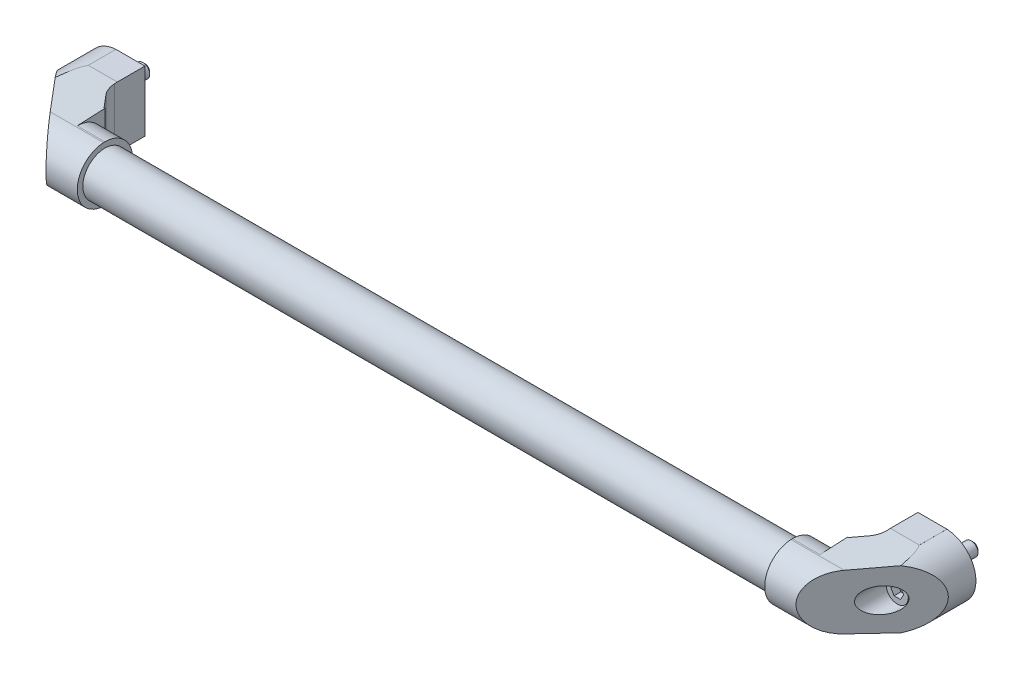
ISO-10303-21;
HEADER;
FILE_DESCRIPTION(('STEP AP214'),'2;1');
FILE_NAME('part.step','',(''),(''),'','','');
FILE_SCHEMA(('AUTOMOTIVE_DESIGN { 1 0 10303 214 1 1 1 1 }'));
ENDSEC;
DATA;
#1=APPLICATION_CONTEXT('core data for automotive mechanical design processes');
#2=APPLICATION_PROTOCOL_DEFINITION('international standard','automotive_design',2000,#1);
#3=PRODUCT_CONTEXT('',#1,'mechanical');
#4=PRODUCT('Part','Part','',(#3));
#5=PRODUCT_RELATED_PRODUCT_CATEGORY('part','',(#4));
#6=PRODUCT_DEFINITION_FORMATION('','',#4);
#7=PRODUCT_DEFINITION_CONTEXT('part definition',#1,'design');
#8=PRODUCT_DEFINITION('design','',#6,#7);
#9=PRODUCT_DEFINITION_SHAPE('','',#8);
#10=(LENGTH_UNIT() NAMED_UNIT(*) SI_UNIT(.MILLI.,.METRE.));
#11=(NAMED_UNIT(*) PLANE_ANGLE_UNIT() SI_UNIT($,.RADIAN.));
#12=(NAMED_UNIT(*) SI_UNIT($,.STERADIAN.) SOLID_ANGLE_UNIT());
#13=UNCERTAINTY_MEASURE_WITH_UNIT(LENGTH_MEASURE(1.E-05),#10,'distance_accuracy_value','');
#14=(GEOMETRIC_REPRESENTATION_CONTEXT(3) GLOBAL_UNCERTAINTY_ASSIGNED_CONTEXT((#13)) GLOBAL_UNIT_ASSIGNED_CONTEXT((#10,
#11,#12)) REPRESENTATION_CONTEXT('',''));
#15=CARTESIAN_POINT('',(0.,0.,0.));
#16=DIRECTION('',(0.,0.,1.));
#17=DIRECTION('',(1.,0.,0.));
#18=AXIS2_PLACEMENT_3D('',#15,#16,#17);
#19=CARTESIAN_POINT('',(0.,0.,25.));
#20=DIRECTION('',(0.,0.,1.));
#21=DIRECTION('',(1.,0.,0.));
#22=AXIS2_PLACEMENT_3D('',#19,#20,#21);
#23=PLANE('',#22);
#24=CARTESIAN_POINT('',(0.,0.,25.));
#25=DIRECTION('',(0.,0.,1.));
#26=DIRECTION('',(1.,0.,0.));
#27=AXIS2_PLACEMENT_3D('',#24,#25,#26);
#28=CIRCLE('',#27,9.);
#29=CARTESIAN_POINT('',(9.,0.,25.));
#30=VERTEX_POINT('',#29);
#31=EDGE_CURVE('E428',#30,#30,#28,.T.);
#32=ORIENTED_EDGE('',*,*,#31,.T.);
#33=EDGE_LOOP('',(#32));
#34=FACE_BOUND('',#33,.T.);
#35=CARTESIAN_POINT('',(0.,0.,25.));
#36=DIRECTION('',(0.,0.,1.));
#37=DIRECTION('',(1.,0.,0.));
#38=AXIS2_PLACEMENT_3D('',#35,#36,#37);
#39=CIRCLE('',#38,8.);
#40=CARTESIAN_POINT('',(8.,0.,25.));
#41=VERTEX_POINT('',#40);
#42=EDGE_CURVE('E404',#41,#41,#39,.T.);
#43=ORIENTED_EDGE('',*,*,#42,.F.);
#44=EDGE_LOOP('',(#43));
#45=FACE_BOUND('',#44,.T.);
#46=ADVANCED_FACE('F14',(#34,#45),#23,.T.);
#47=CARTESIAN_POINT('',(600.,0.,25.));
#48=DIRECTION('',(0.,0.,1.));
#49=DIRECTION('',(1.,0.,0.));
#50=AXIS2_PLACEMENT_3D('',#47,#48,#49);
#51=PLANE('',#50);
#52=CARTESIAN_POINT('',(600.,0.,25.));
#53=DIRECTION('',(0.,0.,1.));
#54=DIRECTION('',(1.,0.,0.));
#55=AXIS2_PLACEMENT_3D('',#52,#53,#54);
#56=CIRCLE('',#55,9.);
#57=CARTESIAN_POINT('',(609.,0.,25.));
#58=VERTEX_POINT('',#57);
#59=EDGE_CURVE('E423',#58,#58,#56,.T.);
#60=ORIENTED_EDGE('',*,*,#59,.T.);
#61=EDGE_LOOP('',(#60));
#62=FACE_BOUND('',#61,.T.);
#63=CARTESIAN_POINT('',(600.,0.,25.));
#64=DIRECTION('',(0.,0.,1.));
#65=DIRECTION('',(1.,0.,0.));
#66=AXIS2_PLACEMENT_3D('',#63,#64,#65);
#67=CIRCLE('',#66,8.);
#68=CARTESIAN_POINT('',(608.,0.,25.));
#69=VERTEX_POINT('',#68);
#70=EDGE_CURVE('E417',#69,#69,#67,.T.);
#71=ORIENTED_EDGE('',*,*,#70,.F.);
#72=EDGE_LOOP('',(#71));
#73=FACE_BOUND('',#72,.T.);
#74=ADVANCED_FACE('F808',(#62,#73),#51,.T.);
#75=CARTESIAN_POINT('',(622.,-19.9756503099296,60.9866076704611));
#76=DIRECTION('',(0.,0.998782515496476,-0.0493303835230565));
#77=DIRECTION('',(0.,0.0493303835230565,0.998782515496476));
#78=AXIS2_PLACEMENT_3D('',#75,#76,#77);
#79=PLANE('',#78);
#80=CARTESIAN_POINT('',(600.,0.,465.429647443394));
#81=DIRECTION('',(0.,0.998782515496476,-0.0493303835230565));
#82=DIRECTION('',(0.,-0.0493303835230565,-0.998782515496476));
#83=AXIS2_PLACEMENT_3D('',#80,#81,#82);
#84=ELLIPSE('',#83,445.972612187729,22.);
#85=CARTESIAN_POINT('',(606.307780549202,-21.0763351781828,38.7012589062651));
#86=VERTEX_POINT('',#85);
#87=CARTESIAN_POINT('',(600.99896854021,-21.9773078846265,20.4594427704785));
#88=VERTEX_POINT('',#87);
#89=EDGE_CURVE('E590',#86,#88,#84,.T.);
#90=ORIENTED_EDGE('',*,*,#89,.F.);
#91=DIRECTION('',(-0.642328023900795,0.0378082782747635,0.765496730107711));
#92=VECTOR('',#91,1.);
#93=CARTESIAN_POINT('',(601.797722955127,-20.8108672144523,44.076136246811));
#94=LINE('',#93,#92);
#95=CARTESIAN_POINT('',(587.608152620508,-19.9756503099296,60.9866076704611));
#96=VERTEX_POINT('',#95);
#97=EDGE_CURVE('E670',#86,#96,#94,.T.);
#98=ORIENTED_EDGE('',*,*,#97,.T.);
#99=DIRECTION('',(-1.,0.,0.));
#100=VECTOR('',#99,1.);
#101=CARTESIAN_POINT('',(622.,-19.9756503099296,60.9866076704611));
#102=LINE('',#101,#100);
#103=CARTESIAN_POINT('',(549.,-19.9756503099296,60.9866076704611));
#104=VERTEX_POINT('',#103);
#105=EDGE_CURVE('E692',#96,#104,#102,.T.);
#106=ORIENTED_EDGE('',*,*,#105,.T.);
#107=DIRECTION('',(0.,-0.0493303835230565,-0.998782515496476));
#108=VECTOR('',#107,1.);
#109=CARTESIAN_POINT('',(549.,-19.9756503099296,60.9866076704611));
#110=LINE('',#109,#108);
#111=CARTESIAN_POINT('',(549.,-20.0243793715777,60.));
#112=VERTEX_POINT('',#111);
#113=EDGE_CURVE('E676',#104,#112,#110,.T.);
#114=ORIENTED_EDGE('',*,*,#113,.T.);
#115=DIRECTION('',(-1.,0.,0.));
#116=VECTOR('',#115,1.);
#117=CARTESIAN_POINT('',(622.,-20.0243793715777,60.));
#118=LINE('',#117,#116);
#119=CARTESIAN_POINT('',(569.,-20.0243793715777,60.));
#120=VERTEX_POINT('',#119);
#121=EDGE_CURVE('E626',#120,#112,#118,.T.);
#122=ORIENTED_EDGE('',*,*,#121,.F.);
#123=DIRECTION('',(0.,0.0493303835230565,0.998782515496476));
#124=VECTOR('',#123,1.);
#125=CARTESIAN_POINT('',(569.,-19.9756503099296,60.9866076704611));
#126=LINE('',#125,#124);
#127=CARTESIAN_POINT('',(569.,-21.0121896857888,40.));
#128=VERTEX_POINT('',#127);
#129=EDGE_CURVE('E621',#128,#120,#126,.T.);
#130=ORIENTED_EDGE('',*,*,#129,.F.);
#131=DIRECTION('',(-1.,0.,0.));
#132=VECTOR('',#131,1.);
#133=CARTESIAN_POINT('',(622.,-21.0121896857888,40.));
#134=LINE('',#133,#132);
#135=CARTESIAN_POINT('',(569.581212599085,-21.0121896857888,40.));
#136=VERTEX_POINT('',#135);
#137=EDGE_CURVE('E652',#136,#128,#134,.T.);
#138=ORIENTED_EDGE('',*,*,#137,.F.);
#139=DIRECTION('',(0.642328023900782,-0.0378082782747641,-0.765496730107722));
#140=VECTOR('',#139,1.);
#141=CARTESIAN_POINT('',(580.864145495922,-21.6763180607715,26.5535241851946));
#142=LINE('',#141,#140);
#143=CARTESIAN_POINT('',(576.510146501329,-21.4200359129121,31.7424181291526));
#144=VERTEX_POINT('',#143);
#145=EDGE_CURVE('E662',#136,#144,#142,.T.);
#146=ORIENTED_EDGE('',*,*,#145,.T.);
#147=CARTESIAN_POINT('',(565.000018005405,-21.8951021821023,22.1238453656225));
#148=DIRECTION('',(0.,0.998782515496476,-0.0493303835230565));
#149=DIRECTION('',(0.,-0.0493303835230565,-0.998782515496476));
#150=AXIS2_PLACEMENT_3D('',#147,#148,#149);
#151=ELLIPSE('',#150,15.0182845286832,15.);
#152=CARTESIAN_POINT('',(580.,-21.8962500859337,22.1006039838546));
#153=VERTEX_POINT('',#152);
#154=EDGE_CURVE('E660',#153,#144,#151,.F.);
#155=ORIENTED_EDGE('',*,*,#154,.F.);
#156=DIRECTION('',(0.,0.0493303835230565,0.998782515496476));
#157=VECTOR('',#156,1.);
#158=CARTESIAN_POINT('',(580.,-19.9756503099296,60.9866076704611));
#159=LINE('',#158,#157);
#160=CARTESIAN_POINT('',(580.,-22.,20.));
#161=VERTEX_POINT('',#160);
#162=EDGE_CURVE('E658',#161,#153,#159,.T.);
#163=ORIENTED_EDGE('',*,*,#162,.F.);
#164=DIRECTION('',(-1.,0.,0.));
#165=VECTOR('',#164,1.);
#166=CARTESIAN_POINT('',(622.,-22.,20.));
#167=LINE('',#166,#165);
#168=CARTESIAN_POINT('',(600.99896854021,-22.,20.));
#169=VERTEX_POINT('',#168);
#170=EDGE_CURVE('E690',#169,#161,#167,.T.);
#171=ORIENTED_EDGE('',*,*,#170,.F.);
#172=DIRECTION('',(0.,-0.0493303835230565,-0.998782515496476));
#173=VECTOR('',#172,1.);
#174=CARTESIAN_POINT('',(600.99896854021,-19.9756503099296,60.9866076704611));
#175=LINE('',#174,#173);
#176=EDGE_CURVE('E595',#88,#169,#175,.T.);
#177=ORIENTED_EDGE('',*,*,#176,.F.);
#178=EDGE_LOOP('',(#90,#98,#106,#114,#122,#130,#138,#146,#155,#163,#171,#177));
#179=FACE_BOUND('',#178,.T.);
#180=ADVANCED_FACE('F16',(#179),#79,.F.);
#181=CARTESIAN_POINT('',(622.,-22.,0.));
#182=DIRECTION('',(0.,0.,1.));
#183=DIRECTION('',(1.,0.,0.));
#184=AXIS2_PLACEMENT_3D('',#181,#182,#183);
#185=PLANE('',#184);
#186=CARTESIAN_POINT('',(600.,0.,0.));
#187=DIRECTION('',(0.,0.,1.));
#188=DIRECTION('',(1.,0.,0.));
#189=AXIS2_PLACEMENT_3D('',#186,#187,#188);
#190=CIRCLE('',#189,4.99999999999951);
#191=CARTESIAN_POINT('',(605.,0.,0.));
#192=VERTEX_POINT('',#191);
#193=EDGE_CURVE('E704',#192,#192,#190,.F.);
#194=ORIENTED_EDGE('',*,*,#193,.F.);
#195=EDGE_LOOP('',(#194));
#196=FACE_BOUND('',#195,.T.);
#197=DIRECTION('',(-1.,0.,0.));
#198=VECTOR('',#197,1.);
#199=CARTESIAN_POINT('',(622.,22.,0.));
#200=LINE('',#199,#198);
#201=CARTESIAN_POINT('',(600.99896854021,22.,0.));
#202=VERTEX_POINT('',#201);
#203=CARTESIAN_POINT('',(580.,22.,0.));
#204=VERTEX_POINT('',#203);
#205=EDGE_CURVE('E686',#202,#204,#200,.T.);
#206=ORIENTED_EDGE('',*,*,#205,.F.);
#207=DIRECTION('',(0.,1.,0.));
#208=VECTOR('',#207,1.);
#209=CARTESIAN_POINT('',(600.99896854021,21.9773078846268,0.));
#210=LINE('',#209,#208);
#211=CARTESIAN_POINT('',(600.99896854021,21.9773078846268,0.));
#212=VERTEX_POINT('',#211);
#213=EDGE_CURVE('E576',#212,#202,#210,.T.);
#214=ORIENTED_EDGE('',*,*,#213,.F.);
#215=CARTESIAN_POINT('',(600.,0.,0.));
#216=DIRECTION('',(0.,0.,-1.));
#217=DIRECTION('',(-1.,0.,0.));
#218=AXIS2_PLACEMENT_3D('',#215,#216,#217);
#219=CIRCLE('',#218,22.);
#220=CARTESIAN_POINT('',(600.99896854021,-21.9773078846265,0.));
#221=VERTEX_POINT('',#220);
#222=EDGE_CURVE('E578',#212,#221,#219,.T.);
#223=ORIENTED_EDGE('',*,*,#222,.T.);
#224=DIRECTION('',(0.,-1.,0.));
#225=VECTOR('',#224,1.);
#226=CARTESIAN_POINT('',(600.99896854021,-21.9773078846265,0.));
#227=LINE('',#226,#225);
#228=CARTESIAN_POINT('',(600.99896854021,-22.,0.));
#229=VERTEX_POINT('',#228);
#230=EDGE_CURVE('E580',#221,#229,#227,.T.);
#231=ORIENTED_EDGE('',*,*,#230,.T.);
#232=DIRECTION('',(-1.,0.,0.));
#233=VECTOR('',#232,1.);
#234=CARTESIAN_POINT('',(622.,-22.,0.));
#235=LINE('',#234,#233);
#236=CARTESIAN_POINT('',(580.,-22.,0.));
#237=VERTEX_POINT('',#236);
#238=EDGE_CURVE('E688',#229,#237,#235,.T.);
#239=ORIENTED_EDGE('',*,*,#238,.T.);
#240=DIRECTION('',(0.,-1.,0.));
#241=VECTOR('',#240,1.);
#242=CARTESIAN_POINT('',(580.,22.,0.));
#243=LINE('',#242,#241);
#244=EDGE_CURVE('E638',#204,#237,#243,.T.);
#245=ORIENTED_EDGE('',*,*,#244,.F.);
#246=EDGE_LOOP('',(#206,#214,#223,#231,#239,#245));
#247=FACE_BOUND('',#246,.T.);
#248=ADVANCED_FACE('F732',(#196,#247),#185,.F.);
#249=CARTESIAN_POINT('',(622.,-22.,0.));
#250=DIRECTION('',(0.,-1.,0.));
#251=DIRECTION('',(1.,0.,0.));
#252=AXIS2_PLACEMENT_3D('',#249,#250,#251);
#253=PLANE('',#252);
#254=ORIENTED_EDGE('',*,*,#238,.F.);
#255=DIRECTION('',(0.,0.,1.));
#256=VECTOR('',#255,1.);
#257=CARTESIAN_POINT('',(600.99896854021,-22.,0.));
#258=LINE('',#257,#256);
#259=EDGE_CURVE('E9',#229,#169,#258,.T.);
#260=ORIENTED_EDGE('',*,*,#259,.T.);
#261=ORIENTED_EDGE('',*,*,#170,.T.);
#262=DIRECTION('',(0.,0.,-1.));
#263=VECTOR('',#262,1.);
#264=CARTESIAN_POINT('',(580.,-22.,0.));
#265=LINE('',#264,#263);
#266=EDGE_CURVE('E655',#161,#237,#265,.T.);
#267=ORIENTED_EDGE('',*,*,#266,.T.);
#268=EDGE_LOOP('',(#254,#260,#261,#267));
#269=FACE_BOUND('',#268,.T.);
#270=ADVANCED_FACE('F737',(#269),#253,.T.);
#271=CARTESIAN_POINT('',(622.,-22.,20.));
#272=DIRECTION('',(-0.766044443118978,0.,-0.64278760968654));
#273=DIRECTION('',(-0.64278760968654,0.,0.766044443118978));
#274=AXIS2_PLACEMENT_3D('',#271,#272,#273);
#275=PLANE('',#274);
#276=CARTESIAN_POINT('',(600.,0.,46.2185790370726));
#277=DIRECTION('',(-0.766044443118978,0.,-0.64278760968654));
#278=DIRECTION('',(-0.64278760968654,0.,0.766044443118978));
#279=AXIS2_PLACEMENT_3D('',#276,#277,#278);
#280=ELLIPSE('',#279,14.0015144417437,9.);
#281=CARTESIAN_POINT('',(591.,0.,56.9443613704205));
#282=VERTEX_POINT('',#281);
#283=EDGE_CURVE('E628',#282,#282,#280,.T.);
#284=ORIENTED_EDGE('',*,*,#283,.T.);
#285=EDGE_LOOP('',(#284));
#286=FACE_BOUND('',#285,.T.);
#287=ORIENTED_EDGE('',*,*,#97,.F.);
#288=CARTESIAN_POINT('',(600.,0.,46.2185790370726));
#289=DIRECTION('',(-0.766044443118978,0.,-0.64278760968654));
#290=DIRECTION('',(0.64278760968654,0.,-0.766044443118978));
#291=AXIS2_PLACEMENT_3D('',#288,#289,#290);
#292=ELLIPSE('',#291,34.225924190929,22.);
#293=CARTESIAN_POINT('',(606.307780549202,21.076335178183,38.7012589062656));
#294=VERTEX_POINT('',#293);
#295=EDGE_CURVE('E713',#294,#86,#292,.T.);
#296=ORIENTED_EDGE('',*,*,#295,.F.);
#297=DIRECTION('',(0.642328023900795,0.0378082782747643,-0.765496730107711));
#298=VECTOR('',#297,1.);
#299=CARTESIAN_POINT('',(622.,22.,20.));
#300=LINE('',#299,#298);
#301=CARTESIAN_POINT('',(587.608152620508,19.9756503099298,60.9866076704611));
#302=VERTEX_POINT('',#301);
#303=EDGE_CURVE('E665',#302,#294,#300,.T.);
#304=ORIENTED_EDGE('',*,*,#303,.F.);
#305=CARTESIAN_POINT('',(588.436014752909,0.,60.));
#306=DIRECTION('',(-0.766044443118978,0.,-0.64278760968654));
#307=DIRECTION('',(-0.64278760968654,0.,0.766044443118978));
#308=AXIS2_PLACEMENT_3D('',#305,#306,#307);
#309=ELLIPSE('',#308,26.1081457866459,20.);
#310=EDGE_CURVE('E668',#96,#302,#309,.T.);
#311=ORIENTED_EDGE('',*,*,#310,.F.);
#312=EDGE_LOOP('',(#287,#296,#304,#311));
#313=FACE_BOUND('',#312,.T.);
#314=ADVANCED_FACE('F787',(#286,#313),#275,.F.);
#315=CARTESIAN_POINT('',(549.,0.,60.));
#316=DIRECTION('',(1.,0.,0.));
#317=DIRECTION('',(0.,1.,0.));
#318=AXIS2_PLACEMENT_3D('',#315,#316,#317);
#319=PLANE('',#318);
#320=CARTESIAN_POINT('',(549.,0.,60.));
#321=DIRECTION('',(1.,0.,0.));
#322=DIRECTION('',(0.,1.,0.));
#323=AXIS2_PLACEMENT_3D('',#320,#321,#322);
#324=CIRCLE('',#323,16.);
#325=CARTESIAN_POINT('',(549.,16.,60.));
#326=VERTEX_POINT('',#325);
#327=EDGE_CURVE('E672',#326,#326,#324,.T.);
#328=ORIENTED_EDGE('',*,*,#327,.T.);
#329=EDGE_LOOP('',(#328));
#330=FACE_BOUND('',#329,.T.);
#331=DIRECTION('',(0.,-1.,0.));
#332=VECTOR('',#331,1.);
#333=CARTESIAN_POINT('',(549.,-20.,60.));
#334=LINE('',#333,#332);
#335=CARTESIAN_POINT('',(549.,-20.,60.));
#336=VERTEX_POINT('',#335);
#337=EDGE_CURVE('E599',#336,#112,#334,.T.);
#338=ORIENTED_EDGE('',*,*,#337,.T.);
#339=ORIENTED_EDGE('',*,*,#113,.F.);
#340=CARTESIAN_POINT('',(549.,0.,60.));
#341=DIRECTION('',(1.,0.,0.));
#342=DIRECTION('',(0.,1.,0.));
#343=AXIS2_PLACEMENT_3D('',#340,#341,#342);
#344=CIRCLE('',#343,20.);
#345=CARTESIAN_POINT('',(549.,19.9756503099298,60.9866076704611));
#346=VERTEX_POINT('',#345);
#347=EDGE_CURVE('E673',#346,#104,#344,.T.);
#348=ORIENTED_EDGE('',*,*,#347,.F.);
#349=DIRECTION('',(0.,-0.0493303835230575,0.998782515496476));
#350=VECTOR('',#349,1.);
#351=CARTESIAN_POINT('',(549.,22.,20.));
#352=LINE('',#351,#350);
#353=CARTESIAN_POINT('',(549.,20.0243793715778,60.));
#354=VERTEX_POINT('',#353);
#355=EDGE_CURVE('E679',#354,#346,#352,.T.);
#356=ORIENTED_EDGE('',*,*,#355,.F.);
#357=DIRECTION('',(0.,1.,0.));
#358=VECTOR('',#357,1.);
#359=CARTESIAN_POINT('',(549.,20.,60.));
#360=LINE('',#359,#358);
#361=CARTESIAN_POINT('',(549.,20.,60.));
#362=VERTEX_POINT('',#361);
#363=EDGE_CURVE('E602',#362,#354,#360,.T.);
#364=ORIENTED_EDGE('',*,*,#363,.F.);
#365=CARTESIAN_POINT('',(549.,0.,60.));
#366=DIRECTION('',(-1.,0.,0.));
#367=DIRECTION('',(0.,-1.,0.));
#368=AXIS2_PLACEMENT_3D('',#365,#366,#367);
#369=CIRCLE('',#368,20.);
#370=EDGE_CURVE('E597',#362,#336,#369,.T.);
#371=ORIENTED_EDGE('',*,*,#370,.T.);
#372=EDGE_LOOP('',(#338,#339,#348,#356,#364,#371));
#373=FACE_BOUND('',#372,.T.);
#374=ADVANCED_FACE('F777',(#330,#373),#319,.F.);
#375=CARTESIAN_POINT('',(549.,22.,40.));
#376=DIRECTION('',(0.,0.,-1.));
#377=DIRECTION('',(-1.,0.,0.));
#378=AXIS2_PLACEMENT_3D('',#375,#376,#377);
#379=PLANE('',#378);
#380=ORIENTED_EDGE('',*,*,#137,.T.);
#381=DIRECTION('',(0.,1.,0.));
#382=VECTOR('',#381,1.);
#383=CARTESIAN_POINT('',(569.,22.,40.));
#384=LINE('',#383,#382);
#385=CARTESIAN_POINT('',(569.,0.,40.));
#386=VERTEX_POINT('',#385);
#387=EDGE_CURVE('E712',#128,#386,#384,.T.);
#388=ORIENTED_EDGE('',*,*,#387,.T.);
#389=CARTESIAN_POINT('',(569.,21.012189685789,40.));
#390=VERTEX_POINT('',#389);
#391=EDGE_CURVE('E707',#386,#390,#384,.T.);
#392=ORIENTED_EDGE('',*,*,#391,.T.);
#393=DIRECTION('',(1.,0.,0.));
#394=VECTOR('',#393,1.);
#395=CARTESIAN_POINT('',(622.,21.012189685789,40.));
#396=LINE('',#395,#394);
#397=CARTESIAN_POINT('',(569.581212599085,21.012189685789,40.));
#398=VERTEX_POINT('',#397);
#399=EDGE_CURVE('E650',#390,#398,#396,.T.);
#400=ORIENTED_EDGE('',*,*,#399,.T.);
#401=DIRECTION('',(0.,-1.,0.));
#402=VECTOR('',#401,1.);
#403=CARTESIAN_POINT('',(569.581212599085,22.,40.));
#404=LINE('',#403,#402);
#405=EDGE_CURVE('E647',#398,#136,#404,.T.);
#406=ORIENTED_EDGE('',*,*,#405,.T.);
#407=EDGE_LOOP('',(#380,#388,#392,#400,#406));
#408=FACE_BOUND('',#407,.T.);
#409=ADVANCED_FACE('F755',(#408),#379,.T.);
#410=CARTESIAN_POINT('',(622.,22.,0.));
#411=DIRECTION('',(0.,-1.,0.));
#412=DIRECTION('',(1.,0.,0.));
#413=AXIS2_PLACEMENT_3D('',#410,#411,#412);
#414=PLANE('',#413);
#415=DIRECTION('',(-1.,0.,0.));
#416=VECTOR('',#415,1.);
#417=CARTESIAN_POINT('',(622.,22.,20.));
#418=LINE('',#417,#416);
#419=CARTESIAN_POINT('',(600.99896854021,22.,20.));
#420=VERTEX_POINT('',#419);
#421=CARTESIAN_POINT('',(580.,22.,20.));
#422=VERTEX_POINT('',#421);
#423=EDGE_CURVE('E684',#420,#422,#418,.T.);
#424=ORIENTED_EDGE('',*,*,#423,.F.);
#425=DIRECTION('',(0.,0.,-1.));
#426=VECTOR('',#425,1.);
#427=CARTESIAN_POINT('',(600.99896854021,22.,0.));
#428=LINE('',#427,#426);
#429=EDGE_CURVE('E592',#420,#202,#428,.T.);
#430=ORIENTED_EDGE('',*,*,#429,.T.);
#431=ORIENTED_EDGE('',*,*,#205,.T.);
#432=DIRECTION('',(0.,0.,-1.));
#433=VECTOR('',#432,1.);
#434=CARTESIAN_POINT('',(580.,22.,22.1006039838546));
#435=LINE('',#434,#433);
#436=EDGE_CURVE('E635',#422,#204,#435,.T.);
#437=ORIENTED_EDGE('',*,*,#436,.F.);
#438=EDGE_LOOP('',(#424,#430,#431,#437));
#439=FACE_BOUND('',#438,.T.);
#440=ADVANCED_FACE('F724',(#439),#414,.F.);
#441=CARTESIAN_POINT('',(622.,22.,20.));
#442=DIRECTION('',(0.,-0.998782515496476,-0.0493303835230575));
#443=DIRECTION('',(0.,0.0493303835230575,-0.998782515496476));
#444=AXIS2_PLACEMENT_3D('',#441,#442,#443);
#445=PLANE('',#444);
#446=CARTESIAN_POINT('',(600.,0.,465.429647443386));
#447=DIRECTION('',(0.,-0.998782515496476,-0.0493303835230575));
#448=DIRECTION('',(0.,0.0493303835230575,-0.998782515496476));
#449=AXIS2_PLACEMENT_3D('',#446,#447,#448);
#450=ELLIPSE('',#449,445.97261218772,22.);
#451=CARTESIAN_POINT('',(600.99896854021,21.9773078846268,20.4594427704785));
#452=VERTEX_POINT('',#451);
#453=EDGE_CURVE('E588',#452,#294,#450,.T.);
#454=ORIENTED_EDGE('',*,*,#453,.F.);
#455=DIRECTION('',(0.,0.0493303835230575,-0.998782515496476));
#456=VECTOR('',#455,1.);
#457=CARTESIAN_POINT('',(600.99896854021,22.,20.));
#458=LINE('',#457,#456);
#459=EDGE_CURVE('E22',#452,#420,#458,.T.);
#460=ORIENTED_EDGE('',*,*,#459,.T.);
#461=ORIENTED_EDGE('',*,*,#423,.T.);
#462=DIRECTION('',(0.,0.0493303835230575,-0.998782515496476));
#463=VECTOR('',#462,1.);
#464=CARTESIAN_POINT('',(580.,22.,20.));
#465=LINE('',#464,#463);
#466=CARTESIAN_POINT('',(580.,21.8962500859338,22.1006039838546));
#467=VERTEX_POINT('',#466);
#468=EDGE_CURVE('E694',#467,#422,#465,.T.);
#469=ORIENTED_EDGE('',*,*,#468,.F.);
#470=CARTESIAN_POINT('',(565.000018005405,21.8951021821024,22.1238453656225));
#471=DIRECTION('',(0.,-0.998782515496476,-0.0493303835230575));
#472=DIRECTION('',(0.,-0.0493303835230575,0.998782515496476));
#473=AXIS2_PLACEMENT_3D('',#470,#471,#472);
#474=ELLIPSE('',#473,15.0182845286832,15.);
#475=CARTESIAN_POINT('',(576.510146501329,21.4200359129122,31.7424181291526));
#476=VERTEX_POINT('',#475);
#477=EDGE_CURVE('E699',#476,#467,#474,.F.);
#478=ORIENTED_EDGE('',*,*,#477,.F.);
#479=DIRECTION('',(-0.642328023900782,-0.0378082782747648,0.765496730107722));
#480=VECTOR('',#479,1.);
#481=CARTESIAN_POINT('',(601.066422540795,22.8654508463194,2.47738793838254));
#482=LINE('',#481,#480);
#483=EDGE_CURVE('E701',#476,#398,#482,.T.);
#484=ORIENTED_EDGE('',*,*,#483,.T.);
#485=ORIENTED_EDGE('',*,*,#399,.F.);
#486=DIRECTION('',(0.,0.0493303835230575,-0.998782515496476));
#487=VECTOR('',#486,1.);
#488=CARTESIAN_POINT('',(569.,22.,20.));
#489=LINE('',#488,#487);
#490=CARTESIAN_POINT('',(569.,20.0243793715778,60.));
#491=VERTEX_POINT('',#490);
#492=EDGE_CURVE('E619',#491,#390,#489,.T.);
#493=ORIENTED_EDGE('',*,*,#492,.F.);
#494=DIRECTION('',(-1.,0.,0.));
#495=VECTOR('',#494,1.);
#496=CARTESIAN_POINT('',(622.,20.0243793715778,60.));
#497=LINE('',#496,#495);
#498=EDGE_CURVE('E623',#491,#354,#497,.T.);
#499=ORIENTED_EDGE('',*,*,#498,.T.);
#500=ORIENTED_EDGE('',*,*,#355,.T.);
#501=DIRECTION('',(-1.,0.,0.));
#502=VECTOR('',#501,1.);
#503=CARTESIAN_POINT('',(622.,19.9756503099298,60.9866076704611));
#504=LINE('',#503,#502);
#505=EDGE_CURVE('E681',#302,#346,#504,.T.);
#506=ORIENTED_EDGE('',*,*,#505,.F.);
#507=ORIENTED_EDGE('',*,*,#303,.T.);
#508=EDGE_LOOP('',(#454,#460,#461,#469,#478,#484,#485,#493,#499,#500,#506,#507));
#509=FACE_BOUND('',#508,.T.);
#510=ADVANCED_FACE('F718',(#509),#445,.F.);
#511=CARTESIAN_POINT('',(622.,0.,60.));
#512=DIRECTION('',(-1.,0.,0.));
#513=DIRECTION('',(0.,-1.,0.));
#514=AXIS2_PLACEMENT_3D('',#511,#512,#513);
#515=CYLINDRICAL_SURFACE('',#514,20.);
#516=ORIENTED_EDGE('',*,*,#310,.T.);
#517=ORIENTED_EDGE('',*,*,#505,.T.);
#518=ORIENTED_EDGE('',*,*,#347,.T.);
#519=ORIENTED_EDGE('',*,*,#105,.F.);
#520=EDGE_LOOP('',(#516,#517,#518,#519));
#521=FACE_BOUND('',#520,.T.);
#522=ADVANCED_FACE('F781',(#521),#515,.T.);
#523=CARTESIAN_POINT('',(591.182067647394,0.,60.));
#524=DIRECTION('',(1.,0.,0.));
#525=DIRECTION('',(0.,1.,0.));
#526=AXIS2_PLACEMENT_3D('',#523,#524,#525);
#527=CYLINDRICAL_SURFACE('',#526,16.);
#528=ORIENTED_EDGE('',*,*,#327,.F.);
#529=EDGE_LOOP('',(#528));
#530=FACE_BOUND('',#529,.T.);
#531=CARTESIAN_POINT('',(51.,0.,60.));
#532=DIRECTION('',(1.,0.,0.));
#533=DIRECTION('',(0.,1.,0.));
#534=AXIS2_PLACEMENT_3D('',#531,#532,#533);
#535=CIRCLE('',#534,16.);
#536=CARTESIAN_POINT('',(51.,16.,60.));
#537=VERTEX_POINT('',#536);
#538=EDGE_CURVE('E527',#537,#537,#535,.T.);
#539=ORIENTED_EDGE('',*,*,#538,.T.);
#540=EDGE_LOOP('',(#539));
#541=FACE_BOUND('',#540,.T.);
#542=ADVANCED_FACE('F1251',(#530,#541),#527,.T.);
#543=CARTESIAN_POINT('',(576.510146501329,22.,31.7424181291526));
#544=DIRECTION('',(0.766044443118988,0.,0.642787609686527));
#545=DIRECTION('',(0.642787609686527,0.,-0.766044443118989));
#546=AXIS2_PLACEMENT_3D('',#543,#544,#545);
#547=PLANE('',#546);
#548=ORIENTED_EDGE('',*,*,#405,.F.);
#549=ORIENTED_EDGE('',*,*,#483,.F.);
#550=DIRECTION('',(0.,-1.,0.));
#551=VECTOR('',#550,1.);
#552=CARTESIAN_POINT('',(576.510146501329,22.,31.7424181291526));
#553=LINE('',#552,#551);
#554=EDGE_CURVE('E644',#476,#144,#553,.T.);
#555=ORIENTED_EDGE('',*,*,#554,.T.);
#556=ORIENTED_EDGE('',*,*,#145,.F.);
#557=EDGE_LOOP('',(#548,#549,#555,#556));
#558=FACE_BOUND('',#557,.T.);
#559=ADVANCED_FACE('F751',(#558),#547,.F.);
#560=CARTESIAN_POINT('',(565.000018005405,22.,22.1238453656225));
#561=DIRECTION('',(0.,-1.,0.));
#562=DIRECTION('',(1.,0.,0.));
#563=AXIS2_PLACEMENT_3D('',#560,#561,#562);
#564=CYLINDRICAL_SURFACE('',#563,15.);
#565=ORIENTED_EDGE('',*,*,#154,.T.);
#566=ORIENTED_EDGE('',*,*,#554,.F.);
#567=ORIENTED_EDGE('',*,*,#477,.T.);
#568=DIRECTION('',(0.,-1.,0.));
#569=VECTOR('',#568,1.);
#570=CARTESIAN_POINT('',(580.,22.,22.1006039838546));
#571=LINE('',#570,#569);
#572=EDGE_CURVE('E641',#467,#153,#571,.T.);
#573=ORIENTED_EDGE('',*,*,#572,.T.);
#574=EDGE_LOOP('',(#565,#566,#567,#573));
#575=FACE_BOUND('',#574,.T.);
#576=ADVANCED_FACE('F747',(#575),#564,.F.);
#577=CARTESIAN_POINT('',(580.,22.,22.1006039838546));
#578=DIRECTION('',(-1.,0.,0.));
#579=DIRECTION('',(0.,-1.,0.));
#580=AXIS2_PLACEMENT_3D('',#577,#578,#579);
#581=PLANE('',#580);
#582=ORIENTED_EDGE('',*,*,#162,.T.);
#583=ORIENTED_EDGE('',*,*,#572,.F.);
#584=ORIENTED_EDGE('',*,*,#468,.T.);
#585=ORIENTED_EDGE('',*,*,#436,.T.);
#586=ORIENTED_EDGE('',*,*,#244,.T.);
#587=ORIENTED_EDGE('',*,*,#266,.F.);
#588=EDGE_LOOP('',(#582,#583,#584,#585,#586,#587));
#589=FACE_BOUND('',#588,.T.);
#590=ADVANCED_FACE('F728',(#589),#581,.T.);
#591=CARTESIAN_POINT('',(600.,0.,31.7424181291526));
#592=DIRECTION('',(0.,0.,1.));
#593=DIRECTION('',(0.,-1.,0.));
#594=AXIS2_PLACEMENT_3D('',#591,#592,#593);
#595=CYLINDRICAL_SURFACE('',#594,4.99999999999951);
#596=CARTESIAN_POINT('',(600.,0.,-18.5));
#597=DIRECTION('',(0.,0.,1.));
#598=DIRECTION('',(0.,-1.,0.));
#599=AXIS2_PLACEMENT_3D('',#596,#597,#598);
#600=CIRCLE('',#599,4.99999999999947);
#601=CARTESIAN_POINT('',(600.,-4.99999999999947,-18.5));
#602=VERTEX_POINT('',#601);
#603=EDGE_CURVE('E629',#602,#602,#600,.T.);
#604=ORIENTED_EDGE('',*,*,#603,.T.);
#605=EDGE_LOOP('',(#604));
#606=FACE_BOUND('',#605,.T.);
#607=ORIENTED_EDGE('',*,*,#193,.T.);
#608=EDGE_LOOP('',(#607));
#609=FACE_BOUND('',#608,.T.);
#610=ADVANCED_FACE('F1204',(#606,#609),#595,.T.);
#611=CARTESIAN_POINT('',(600.,0.,-20.));
#612=DIRECTION('',(0.,0.,1.));
#613=DIRECTION('',(0.,-1.,0.));
#614=AXIS2_PLACEMENT_3D('',#611,#612,#613);
#615=PLANE('',#614);
#616=CARTESIAN_POINT('',(600.,0.,-20.));
#617=DIRECTION('',(0.,0.,1.));
#618=DIRECTION('',(0.,-1.,0.));
#619=AXIS2_PLACEMENT_3D('',#616,#617,#618);
#620=CIRCLE('',#619,3.49999999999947);
#621=CARTESIAN_POINT('',(600.,-3.49999999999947,-20.));
#622=VERTEX_POINT('',#621);
#623=EDGE_CURVE('E632',#622,#622,#620,.T.);
#624=ORIENTED_EDGE('',*,*,#623,.F.);
#625=EDGE_LOOP('',(#624));
#626=FACE_BOUND('',#625,.T.);
#627=ADVANCED_FACE('F1209',(#626),#615,.F.);
#628=CARTESIAN_POINT('',(600.,0.,-20.));
#629=DIRECTION('',(0.,0.,1.));
#630=DIRECTION('',(0.,-1.,0.));
#631=AXIS2_PLACEMENT_3D('',#628,#629,#630);
#632=CONICAL_SURFACE('',#631,3.49999999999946,0.785398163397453);
#633=ORIENTED_EDGE('',*,*,#603,.F.);
#634=EDGE_LOOP('',(#633));
#635=FACE_BOUND('',#634,.T.);
#636=ORIENTED_EDGE('',*,*,#623,.T.);
#637=EDGE_LOOP('',(#636));
#638=FACE_BOUND('',#637,.T.);
#639=ADVANCED_FACE('F1156',(#635,#638),#632,.T.);
#640=CARTESIAN_POINT('',(600.,0.,30.));
#641=DIRECTION('',(0.,0.,1.));
#642=DIRECTION('',(1.,0.,0.));
#643=AXIS2_PLACEMENT_3D('',#640,#641,#642);
#644=CYLINDRICAL_SURFACE('',#643,9.);
#645=ORIENTED_EDGE('',*,*,#283,.F.);
#646=EDGE_LOOP('',(#645));
#647=FACE_BOUND('',#646,.T.);
#648=ORIENTED_EDGE('',*,*,#59,.F.);
#649=EDGE_LOOP('',(#648));
#650=FACE_BOUND('',#649,.T.);
#651=ADVANCED_FACE('F1150',(#647,#650),#644,.F.);
#652=CARTESIAN_POINT('',(569.,-20.,60.));
#653=DIRECTION('',(0.,0.,-1.));
#654=DIRECTION('',(-1.,0.,0.));
#655=AXIS2_PLACEMENT_3D('',#652,#653,#654);
#656=PLANE('',#655);
#657=ORIENTED_EDGE('',*,*,#121,.T.);
#658=ORIENTED_EDGE('',*,*,#337,.F.);
#659=DIRECTION('',(-1.,0.,0.));
#660=VECTOR('',#659,1.);
#661=CARTESIAN_POINT('',(569.,-20.,60.));
#662=LINE('',#661,#660);
#663=CARTESIAN_POINT('',(569.,-20.,60.));
#664=VERTEX_POINT('',#663);
#665=EDGE_CURVE('E616',#664,#336,#662,.T.);
#666=ORIENTED_EDGE('',*,*,#665,.F.);
#667=DIRECTION('',(0.,-1.,0.));
#668=VECTOR('',#667,1.);
#669=CARTESIAN_POINT('',(569.,-20.,60.));
#670=LINE('',#669,#668);
#671=EDGE_CURVE('E608',#664,#120,#670,.T.);
#672=ORIENTED_EDGE('',*,*,#671,.T.);
#673=EDGE_LOOP('',(#657,#658,#666,#672));
#674=FACE_BOUND('',#673,.T.);
#675=ADVANCED_FACE('F1155',(#674),#656,.T.);
#676=CARTESIAN_POINT('',(569.,20.,60.));
#677=DIRECTION('',(0.,0.,1.));
#678=DIRECTION('',(1.,0.,0.));
#679=AXIS2_PLACEMENT_3D('',#676,#677,#678);
#680=PLANE('',#679);
#681=DIRECTION('',(0.,1.,0.));
#682=VECTOR('',#681,1.);
#683=CARTESIAN_POINT('',(569.,20.,60.));
#684=LINE('',#683,#682);
#685=CARTESIAN_POINT('',(569.,20.,60.));
#686=VERTEX_POINT('',#685);
#687=EDGE_CURVE('E611',#686,#491,#684,.T.);
#688=ORIENTED_EDGE('',*,*,#687,.F.);
#689=DIRECTION('',(-1.,0.,0.));
#690=VECTOR('',#689,1.);
#691=CARTESIAN_POINT('',(569.,20.,60.));
#692=LINE('',#691,#690);
#693=EDGE_CURVE('E614',#686,#362,#692,.T.);
#694=ORIENTED_EDGE('',*,*,#693,.T.);
#695=ORIENTED_EDGE('',*,*,#363,.T.);
#696=ORIENTED_EDGE('',*,*,#498,.F.);
#697=EDGE_LOOP('',(#688,#694,#695,#696));
#698=FACE_BOUND('',#697,.T.);
#699=ADVANCED_FACE('F772',(#698),#680,.F.);
#700=CARTESIAN_POINT('',(569.,0.,60.));
#701=DIRECTION('',(-1.,0.,0.));
#702=DIRECTION('',(0.,-1.,0.));
#703=AXIS2_PLACEMENT_3D('',#700,#701,#702);
#704=CYLINDRICAL_SURFACE('',#703,20.);
#705=CARTESIAN_POINT('',(569.,0.,60.));
#706=DIRECTION('',(-1.,0.,0.));
#707=DIRECTION('',(0.,-1.,0.));
#708=AXIS2_PLACEMENT_3D('',#705,#706,#707);
#709=CIRCLE('',#708,20.);
#710=EDGE_CURVE('E605',#686,#386,#709,.T.);
#711=ORIENTED_EDGE('',*,*,#710,.T.);
#712=EDGE_CURVE('E604',#386,#664,#709,.T.);
#713=ORIENTED_EDGE('',*,*,#712,.T.);
#714=ORIENTED_EDGE('',*,*,#665,.T.);
#715=ORIENTED_EDGE('',*,*,#370,.F.);
#716=ORIENTED_EDGE('',*,*,#693,.F.);
#717=EDGE_LOOP('',(#711,#713,#714,#715,#716));
#718=FACE_BOUND('',#717,.T.);
#719=ADVANCED_FACE('F768',(#718),#704,.T.);
#720=CARTESIAN_POINT('',(569.,0.,60.));
#721=DIRECTION('',(-1.,0.,0.));
#722=DIRECTION('',(0.,-1.,0.));
#723=AXIS2_PLACEMENT_3D('',#720,#721,#722);
#724=PLANE('',#723);
#725=ORIENTED_EDGE('',*,*,#129,.T.);
#726=ORIENTED_EDGE('',*,*,#671,.F.);
#727=ORIENTED_EDGE('',*,*,#712,.F.);
#728=ORIENTED_EDGE('',*,*,#387,.F.);
#729=EDGE_LOOP('',(#725,#726,#727,#728));
#730=FACE_BOUND('',#729,.T.);
#731=ADVANCED_FACE('F764',(#730),#724,.T.);
#732=ORIENTED_EDGE('',*,*,#492,.T.);
#733=ORIENTED_EDGE('',*,*,#391,.F.);
#734=ORIENTED_EDGE('',*,*,#710,.F.);
#735=ORIENTED_EDGE('',*,*,#687,.T.);
#736=EDGE_LOOP('',(#732,#733,#734,#735));
#737=FACE_BOUND('',#736,.T.);
#738=ADVANCED_FACE('F760',(#737),#724,.T.);
#739=CARTESIAN_POINT('',(600.99896854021,-21.9773078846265,80.));
#740=DIRECTION('',(1.,0.,0.));
#741=DIRECTION('',(0.,1.,0.));
#742=AXIS2_PLACEMENT_3D('',#739,#740,#741);
#743=PLANE('',#742);
#744=ORIENTED_EDGE('',*,*,#176,.T.);
#745=ORIENTED_EDGE('',*,*,#259,.F.);
#746=ORIENTED_EDGE('',*,*,#230,.F.);
#747=DIRECTION('',(0.,0.,-1.));
#748=VECTOR('',#747,1.);
#749=CARTESIAN_POINT('',(600.99896854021,-21.9773078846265,80.));
#750=LINE('',#749,#748);
#751=EDGE_CURVE('E583',#88,#221,#750,.T.);
#752=ORIENTED_EDGE('',*,*,#751,.F.);
#753=EDGE_LOOP('',(#744,#745,#746,#752));
#754=FACE_BOUND('',#753,.T.);
#755=ADVANCED_FACE('F792',(#754),#743,.T.);
#756=CARTESIAN_POINT('',(600.99896854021,21.9773078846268,80.));
#757=DIRECTION('',(-1.,0.,0.));
#758=DIRECTION('',(0.,-1.,0.));
#759=AXIS2_PLACEMENT_3D('',#756,#757,#758);
#760=PLANE('',#759);
#761=ORIENTED_EDGE('',*,*,#459,.F.);
#762=DIRECTION('',(0.,0.,-1.));
#763=VECTOR('',#762,1.);
#764=CARTESIAN_POINT('',(600.99896854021,21.9773078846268,80.));
#765=LINE('',#764,#763);
#766=EDGE_CURVE('E586',#452,#212,#765,.T.);
#767=ORIENTED_EDGE('',*,*,#766,.T.);
#768=ORIENTED_EDGE('',*,*,#213,.T.);
#769=ORIENTED_EDGE('',*,*,#429,.F.);
#770=EDGE_LOOP('',(#761,#767,#768,#769));
#771=FACE_BOUND('',#770,.T.);
#772=ADVANCED_FACE('F794',(#771),#760,.F.);
#773=CARTESIAN_POINT('',(600.,0.,80.));
#774=DIRECTION('',(0.,0.,-1.));
#775=DIRECTION('',(-1.,0.,0.));
#776=AXIS2_PLACEMENT_3D('',#773,#774,#775);
#777=CYLINDRICAL_SURFACE('',#776,22.);
#778=ORIENTED_EDGE('',*,*,#295,.T.);
#779=ORIENTED_EDGE('',*,*,#89,.T.);
#780=ORIENTED_EDGE('',*,*,#751,.T.);
#781=ORIENTED_EDGE('',*,*,#222,.F.);
#782=ORIENTED_EDGE('',*,*,#766,.F.);
#783=ORIENTED_EDGE('',*,*,#453,.T.);
#784=EDGE_LOOP('',(#778,#779,#780,#781,#782,#783));
#785=FACE_BOUND('',#784,.T.);
#786=ADVANCED_FACE('F789',(#785),#777,.T.);
#787=CARTESIAN_POINT('',(-22.,-19.9756503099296,60.9866076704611));
#788=DIRECTION('',(0.,0.998782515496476,-0.0493303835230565));
#789=DIRECTION('',(0.,0.0493303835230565,0.998782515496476));
#790=AXIS2_PLACEMENT_3D('',#787,#788,#789);
#791=PLANE('',#790);
#792=CARTESIAN_POINT('',(0.,0.,465.429647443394));
#793=DIRECTION('',(0.,-0.998782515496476,0.0493303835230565));
#794=DIRECTION('',(0.,-0.0493303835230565,-0.998782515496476));
#795=AXIS2_PLACEMENT_3D('',#792,#793,#794);
#796=ELLIPSE('',#795,445.972612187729,22.);
#797=CARTESIAN_POINT('',(-6.307780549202,-21.0763351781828,38.7012589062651));
#798=VERTEX_POINT('',#797);
#799=CARTESIAN_POINT('',(-0.998968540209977,-21.9773078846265,20.4594427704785));
#800=VERTEX_POINT('',#799);
#801=EDGE_CURVE('E445',#798,#800,#796,.T.);
#802=ORIENTED_EDGE('',*,*,#801,.T.);
#803=DIRECTION('',(0.,-0.0493303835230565,-0.998782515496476));
#804=VECTOR('',#803,1.);
#805=CARTESIAN_POINT('',(-0.998968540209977,-19.9756503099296,60.9866076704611));
#806=LINE('',#805,#804);
#807=CARTESIAN_POINT('',(-0.998968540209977,-22.,20.));
#808=VERTEX_POINT('',#807);
#809=EDGE_CURVE('E450',#800,#808,#806,.T.);
#810=ORIENTED_EDGE('',*,*,#809,.T.);
#811=DIRECTION('',(1.,0.,0.));
#812=VECTOR('',#811,1.);
#813=CARTESIAN_POINT('',(-22.,-22.,20.));
#814=LINE('',#813,#812);
#815=CARTESIAN_POINT('',(20.,-22.,20.));
#816=VERTEX_POINT('',#815);
#817=EDGE_CURVE('E545',#808,#816,#814,.T.);
#818=ORIENTED_EDGE('',*,*,#817,.T.);
#819=DIRECTION('',(0.,0.0493303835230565,0.998782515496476));
#820=VECTOR('',#819,1.);
#821=CARTESIAN_POINT('',(20.,-19.9756503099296,60.9866076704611));
#822=LINE('',#821,#820);
#823=CARTESIAN_POINT('',(20.,-21.8962500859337,22.1006039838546));
#824=VERTEX_POINT('',#823);
#825=EDGE_CURVE('E513',#816,#824,#822,.T.);
#826=ORIENTED_EDGE('',*,*,#825,.T.);
#827=CARTESIAN_POINT('',(34.9999819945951,-21.8951021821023,22.1238453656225));
#828=DIRECTION('',(0.,-0.998782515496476,0.0493303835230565));
#829=DIRECTION('',(0.,-0.0493303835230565,-0.998782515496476));
#830=AXIS2_PLACEMENT_3D('',#827,#828,#829);
#831=ELLIPSE('',#830,15.0182845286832,15.);
#832=CARTESIAN_POINT('',(23.489853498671,-21.4200359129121,31.7424181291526));
#833=VERTEX_POINT('',#832);
#834=EDGE_CURVE('E515',#824,#833,#831,.F.);
#835=ORIENTED_EDGE('',*,*,#834,.T.);
#836=DIRECTION('',(-0.642328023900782,-0.0378082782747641,-0.765496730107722));
#837=VECTOR('',#836,1.);
#838=CARTESIAN_POINT('',(19.1358545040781,-21.6763180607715,26.5535241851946));
#839=LINE('',#838,#837);
#840=CARTESIAN_POINT('',(30.4187874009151,-21.0121896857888,40.));
#841=VERTEX_POINT('',#840);
#842=EDGE_CURVE('E517',#841,#833,#839,.T.);
#843=ORIENTED_EDGE('',*,*,#842,.F.);
#844=DIRECTION('',(1.,0.,0.));
#845=VECTOR('',#844,1.);
#846=CARTESIAN_POINT('',(-22.,-21.0121896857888,40.));
#847=LINE('',#846,#845);
#848=CARTESIAN_POINT('',(31.,-21.0121896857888,40.));
#849=VERTEX_POINT('',#848);
#850=EDGE_CURVE('E507',#841,#849,#847,.T.);
#851=ORIENTED_EDGE('',*,*,#850,.T.);
#852=DIRECTION('',(0.,0.0493303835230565,0.998782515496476));
#853=VECTOR('',#852,1.);
#854=CARTESIAN_POINT('',(31.,-19.9756503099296,60.9866076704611));
#855=LINE('',#854,#853);
#856=CARTESIAN_POINT('',(31.,-20.0243793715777,60.));
#857=VERTEX_POINT('',#856);
#858=EDGE_CURVE('E476',#849,#857,#855,.T.);
#859=ORIENTED_EDGE('',*,*,#858,.T.);
#860=DIRECTION('',(1.,0.,0.));
#861=VECTOR('',#860,1.);
#862=CARTESIAN_POINT('',(-22.,-20.0243793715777,60.));
#863=LINE('',#862,#861);
#864=CARTESIAN_POINT('',(51.,-20.0243793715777,60.));
#865=VERTEX_POINT('',#864);
#866=EDGE_CURVE('E481',#857,#865,#863,.T.);
#867=ORIENTED_EDGE('',*,*,#866,.T.);
#868=DIRECTION('',(0.,-0.0493303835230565,-0.998782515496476));
#869=VECTOR('',#868,1.);
#870=CARTESIAN_POINT('',(51.,-19.9756503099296,60.9866076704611));
#871=LINE('',#870,#869);
#872=CARTESIAN_POINT('',(51.,-19.9756503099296,60.9866076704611));
#873=VERTEX_POINT('',#872);
#874=EDGE_CURVE('E531',#873,#865,#871,.T.);
#875=ORIENTED_EDGE('',*,*,#874,.F.);
#876=DIRECTION('',(1.,0.,0.));
#877=VECTOR('',#876,1.);
#878=CARTESIAN_POINT('',(-22.,-19.9756503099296,60.9866076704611));
#879=LINE('',#878,#877);
#880=CARTESIAN_POINT('',(12.3918473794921,-19.9756503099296,60.9866076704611));
#881=VERTEX_POINT('',#880);
#882=EDGE_CURVE('E547',#881,#873,#879,.T.);
#883=ORIENTED_EDGE('',*,*,#882,.F.);
#884=DIRECTION('',(0.642328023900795,0.0378082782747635,0.765496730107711));
#885=VECTOR('',#884,1.);
#886=CARTESIAN_POINT('',(-1.79772295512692,-20.8108672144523,44.076136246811));
#887=LINE('',#886,#885);
#888=EDGE_CURVE('E525',#798,#881,#887,.T.);
#889=ORIENTED_EDGE('',*,*,#888,.F.);
#890=EDGE_LOOP('',(#802,#810,#818,#826,#835,#843,#851,#859,#867,#875,#883,#889));
#891=FACE_BOUND('',#890,.T.);
#892=ADVANCED_FACE('F803',(#891),#791,.F.);
#893=CARTESIAN_POINT('',(-22.,-22.,0.));
#894=DIRECTION('',(0.,0.,1.));
#895=DIRECTION('',(-1.,0.,0.));
#896=AXIS2_PLACEMENT_3D('',#893,#894,#895);
#897=PLANE('',#896);
#898=CARTESIAN_POINT('',(0.,0.,0.));
#899=DIRECTION('',(0.,0.,-1.));
#900=DIRECTION('',(-1.,0.,0.));
#901=AXIS2_PLACEMENT_3D('',#898,#899,#900);
#902=CIRCLE('',#901,4.99999999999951);
#903=CARTESIAN_POINT('',(-4.99999999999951,0.,0.));
#904=VERTEX_POINT('',#903);
#905=EDGE_CURVE('E559',#904,#904,#902,.F.);
#906=ORIENTED_EDGE('',*,*,#905,.T.);
#907=EDGE_LOOP('',(#906));
#908=FACE_BOUND('',#907,.T.);
#909=DIRECTION('',(1.,0.,0.));
#910=VECTOR('',#909,1.);
#911=CARTESIAN_POINT('',(-22.,22.,0.));
#912=LINE('',#911,#910);
#913=CARTESIAN_POINT('',(-0.998968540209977,22.,0.));
#914=VERTEX_POINT('',#913);
#915=CARTESIAN_POINT('',(20.,22.,0.));
#916=VERTEX_POINT('',#915);
#917=EDGE_CURVE('E541',#914,#916,#912,.T.);
#918=ORIENTED_EDGE('',*,*,#917,.T.);
#919=DIRECTION('',(0.,-1.,0.));
#920=VECTOR('',#919,1.);
#921=CARTESIAN_POINT('',(20.,22.,0.));
#922=LINE('',#921,#920);
#923=CARTESIAN_POINT('',(20.,-22.,0.));
#924=VERTEX_POINT('',#923);
#925=EDGE_CURVE('E493',#916,#924,#922,.T.);
#926=ORIENTED_EDGE('',*,*,#925,.T.);
#927=DIRECTION('',(1.,0.,0.));
#928=VECTOR('',#927,1.);
#929=CARTESIAN_POINT('',(-22.,-22.,0.));
#930=LINE('',#929,#928);
#931=CARTESIAN_POINT('',(-0.998968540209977,-22.,0.));
#932=VERTEX_POINT('',#931);
#933=EDGE_CURVE('E543',#932,#924,#930,.T.);
#934=ORIENTED_EDGE('',*,*,#933,.F.);
#935=DIRECTION('',(0.,-1.,0.));
#936=VECTOR('',#935,1.);
#937=CARTESIAN_POINT('',(-0.998968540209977,-21.9773078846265,0.));
#938=LINE('',#937,#936);
#939=CARTESIAN_POINT('',(-0.998968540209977,-21.9773078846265,0.));
#940=VERTEX_POINT('',#939);
#941=EDGE_CURVE('E435',#940,#932,#938,.T.);
#942=ORIENTED_EDGE('',*,*,#941,.F.);
#943=CARTESIAN_POINT('',(0.,0.,0.));
#944=DIRECTION('',(0.,0.,1.));
#945=DIRECTION('',(1.,0.,0.));
#946=AXIS2_PLACEMENT_3D('',#943,#944,#945);
#947=CIRCLE('',#946,22.);
#948=CARTESIAN_POINT('',(-0.998968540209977,21.9773078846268,0.));
#949=VERTEX_POINT('',#948);
#950=EDGE_CURVE('E433',#949,#940,#947,.T.);
#951=ORIENTED_EDGE('',*,*,#950,.F.);
#952=DIRECTION('',(0.,1.,0.));
#953=VECTOR('',#952,1.);
#954=CARTESIAN_POINT('',(-0.998968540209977,21.9773078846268,0.));
#955=LINE('',#954,#953);
#956=EDGE_CURVE('E431',#949,#914,#955,.T.);
#957=ORIENTED_EDGE('',*,*,#956,.T.);
#958=EDGE_LOOP('',(#918,#926,#934,#942,#951,#957));
#959=FACE_BOUND('',#958,.T.);
#960=ADVANCED_FACE('F903',(#908,#959),#897,.F.);
#961=CARTESIAN_POINT('',(-22.,-22.,0.));
#962=DIRECTION('',(0.,-1.,0.));
#963=DIRECTION('',(-1.,0.,0.));
#964=AXIS2_PLACEMENT_3D('',#961,#962,#963);
#965=PLANE('',#964);
#966=ORIENTED_EDGE('',*,*,#933,.T.);
#967=DIRECTION('',(0.,0.,-1.));
#968=VECTOR('',#967,1.);
#969=CARTESIAN_POINT('',(20.,-22.,0.));
#970=LINE('',#969,#968);
#971=EDGE_CURVE('E510',#816,#924,#970,.T.);
#972=ORIENTED_EDGE('',*,*,#971,.F.);
#973=ORIENTED_EDGE('',*,*,#817,.F.);
#974=DIRECTION('',(0.,0.,1.));
#975=VECTOR('',#974,1.);
#976=CARTESIAN_POINT('',(-0.998968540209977,-22.,0.));
#977=LINE('',#976,#975);
#978=EDGE_CURVE('E573',#932,#808,#977,.T.);
#979=ORIENTED_EDGE('',*,*,#978,.F.);
#980=EDGE_LOOP('',(#966,#972,#973,#979));
#981=FACE_BOUND('',#980,.T.);
#982=ADVANCED_FACE('F888',(#981),#965,.T.);
#983=CARTESIAN_POINT('',(-22.,-22.,20.));
#984=DIRECTION('',(0.766044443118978,0.,-0.64278760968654));
#985=DIRECTION('',(0.64278760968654,0.,0.766044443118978));
#986=AXIS2_PLACEMENT_3D('',#983,#984,#985);
#987=PLANE('',#986);
#988=CARTESIAN_POINT('',(0.,0.,46.2185790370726));
#989=DIRECTION('',(-0.766044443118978,0.,0.64278760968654));
#990=DIRECTION('',(0.64278760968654,0.,0.766044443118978));
#991=AXIS2_PLACEMENT_3D('',#988,#989,#990);
#992=ELLIPSE('',#991,14.0015144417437,9.);
#993=CARTESIAN_POINT('',(9.,0.,56.9443613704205));
#994=VERTEX_POINT('',#993);
#995=EDGE_CURVE('E483',#994,#994,#992,.T.);
#996=ORIENTED_EDGE('',*,*,#995,.F.);
#997=EDGE_LOOP('',(#996));
#998=FACE_BOUND('',#997,.T.);
#999=ORIENTED_EDGE('',*,*,#888,.T.);
#1000=CARTESIAN_POINT('',(11.5639852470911,0.,60.));
#1001=DIRECTION('',(-0.766044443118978,0.,0.64278760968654));
#1002=DIRECTION('',(0.64278760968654,0.,0.766044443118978));
#1003=AXIS2_PLACEMENT_3D('',#1000,#1001,#1002);
#1004=ELLIPSE('',#1003,26.1081457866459,20.);
#1005=CARTESIAN_POINT('',(12.3918473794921,19.9756503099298,60.9866076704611));
#1006=VERTEX_POINT('',#1005);
#1007=EDGE_CURVE('E523',#881,#1006,#1004,.T.);
#1008=ORIENTED_EDGE('',*,*,#1007,.T.);
#1009=DIRECTION('',(-0.642328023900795,0.0378082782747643,-0.765496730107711));
#1010=VECTOR('',#1009,1.);
#1011=CARTESIAN_POINT('',(-22.,22.,20.));
#1012=LINE('',#1011,#1010);
#1013=CARTESIAN_POINT('',(-6.307780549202,21.076335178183,38.7012589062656));
#1014=VERTEX_POINT('',#1013);
#1015=EDGE_CURVE('E520',#1006,#1014,#1012,.T.);
#1016=ORIENTED_EDGE('',*,*,#1015,.T.);
#1017=CARTESIAN_POINT('',(0.,0.,46.2185790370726));
#1018=DIRECTION('',(-0.766044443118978,0.,0.64278760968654));
#1019=DIRECTION('',(-0.64278760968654,0.,-0.766044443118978));
#1020=AXIS2_PLACEMENT_3D('',#1017,#1018,#1019);
#1021=ELLIPSE('',#1020,34.225924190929,22.);
#1022=EDGE_CURVE('E568',#1014,#798,#1021,.T.);
#1023=ORIENTED_EDGE('',*,*,#1022,.T.);
#1024=EDGE_LOOP('',(#999,#1008,#1016,#1023));
#1025=FACE_BOUND('',#1024,.T.);
#1026=ADVANCED_FACE('F885',(#998,#1025),#987,.F.);
#1027=CARTESIAN_POINT('',(51.,0.,60.));
#1028=DIRECTION('',(-1.,0.,0.));
#1029=DIRECTION('',(0.,1.,0.));
#1030=AXIS2_PLACEMENT_3D('',#1027,#1028,#1029);
#1031=PLANE('',#1030);
#1032=ORIENTED_EDGE('',*,*,#538,.F.);
#1033=EDGE_LOOP('',(#1032));
#1034=FACE_BOUND('',#1033,.T.);
#1035=DIRECTION('',(0.,-1.,0.));
#1036=VECTOR('',#1035,1.);
#1037=CARTESIAN_POINT('',(51.,-20.,60.));
#1038=LINE('',#1037,#1036);
#1039=CARTESIAN_POINT('',(51.,-20.,60.));
#1040=VERTEX_POINT('',#1039);
#1041=EDGE_CURVE('E454',#1040,#865,#1038,.T.);
#1042=ORIENTED_EDGE('',*,*,#1041,.F.);
#1043=CARTESIAN_POINT('',(51.,0.,60.));
#1044=DIRECTION('',(-1.,0.,0.));
#1045=DIRECTION('',(0.,-1.,0.));
#1046=AXIS2_PLACEMENT_3D('',#1043,#1044,#1045);
#1047=CIRCLE('',#1046,20.);
#1048=CARTESIAN_POINT('',(51.,20.,60.));
#1049=VERTEX_POINT('',#1048);
#1050=EDGE_CURVE('E452',#1049,#1040,#1047,.T.);
#1051=ORIENTED_EDGE('',*,*,#1050,.F.);
#1052=DIRECTION('',(0.,1.,0.));
#1053=VECTOR('',#1052,1.);
#1054=CARTESIAN_POINT('',(51.,20.,60.));
#1055=LINE('',#1054,#1053);
#1056=CARTESIAN_POINT('',(51.,20.0243793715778,60.));
#1057=VERTEX_POINT('',#1056);
#1058=EDGE_CURVE('E457',#1049,#1057,#1055,.T.);
#1059=ORIENTED_EDGE('',*,*,#1058,.T.);
#1060=DIRECTION('',(0.,-0.0493303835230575,0.998782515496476));
#1061=VECTOR('',#1060,1.);
#1062=CARTESIAN_POINT('',(51.,22.,20.));
#1063=LINE('',#1062,#1061);
#1064=CARTESIAN_POINT('',(51.,19.9756503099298,60.9866076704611));
#1065=VERTEX_POINT('',#1064);
#1066=EDGE_CURVE('E534',#1057,#1065,#1063,.T.);
#1067=ORIENTED_EDGE('',*,*,#1066,.T.);
#1068=CARTESIAN_POINT('',(51.,0.,60.));
#1069=DIRECTION('',(1.,0.,0.));
#1070=DIRECTION('',(0.,1.,0.));
#1071=AXIS2_PLACEMENT_3D('',#1068,#1069,#1070);
#1072=CIRCLE('',#1071,20.);
#1073=EDGE_CURVE('E528',#1065,#873,#1072,.T.);
#1074=ORIENTED_EDGE('',*,*,#1073,.T.);
#1075=ORIENTED_EDGE('',*,*,#874,.T.);
#1076=EDGE_LOOP('',(#1042,#1051,#1059,#1067,#1074,#1075));
#1077=FACE_BOUND('',#1076,.T.);
#1078=ADVANCED_FACE('F883',(#1034,#1077),#1031,.F.);
#1079=CARTESIAN_POINT('',(51.,22.,40.));
#1080=DIRECTION('',(0.,0.,-1.));
#1081=DIRECTION('',(1.,0.,0.));
#1082=AXIS2_PLACEMENT_3D('',#1079,#1080,#1081);
#1083=PLANE('',#1082);
#1084=ORIENTED_EDGE('',*,*,#850,.F.);
#1085=DIRECTION('',(0.,-1.,0.));
#1086=VECTOR('',#1085,1.);
#1087=CARTESIAN_POINT('',(30.4187874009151,22.,40.));
#1088=LINE('',#1087,#1086);
#1089=CARTESIAN_POINT('',(30.4187874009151,21.012189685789,40.));
#1090=VERTEX_POINT('',#1089);
#1091=EDGE_CURVE('E502',#1090,#841,#1088,.T.);
#1092=ORIENTED_EDGE('',*,*,#1091,.F.);
#1093=DIRECTION('',(-1.,0.,0.));
#1094=VECTOR('',#1093,1.);
#1095=CARTESIAN_POINT('',(-22.,21.012189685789,40.));
#1096=LINE('',#1095,#1094);
#1097=CARTESIAN_POINT('',(31.,21.012189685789,40.));
#1098=VERTEX_POINT('',#1097);
#1099=EDGE_CURVE('E505',#1098,#1090,#1096,.T.);
#1100=ORIENTED_EDGE('',*,*,#1099,.F.);
#1101=DIRECTION('',(0.,1.,0.));
#1102=VECTOR('',#1101,1.);
#1103=CARTESIAN_POINT('',(31.,22.,40.));
#1104=LINE('',#1103,#1102);
#1105=CARTESIAN_POINT('',(31.,0.,40.));
#1106=VERTEX_POINT('',#1105);
#1107=EDGE_CURVE('E562',#1106,#1098,#1104,.T.);
#1108=ORIENTED_EDGE('',*,*,#1107,.F.);
#1109=EDGE_CURVE('E567',#849,#1106,#1104,.T.);
#1110=ORIENTED_EDGE('',*,*,#1109,.F.);
#1111=EDGE_LOOP('',(#1084,#1092,#1100,#1108,#1110));
#1112=FACE_BOUND('',#1111,.T.);
#1113=ADVANCED_FACE('F879',(#1112),#1083,.T.);
#1114=CARTESIAN_POINT('',(-22.,22.,0.));
#1115=DIRECTION('',(0.,-1.,0.));
#1116=DIRECTION('',(-1.,0.,0.));
#1117=AXIS2_PLACEMENT_3D('',#1114,#1115,#1116);
#1118=PLANE('',#1117);
#1119=DIRECTION('',(1.,0.,0.));
#1120=VECTOR('',#1119,1.);
#1121=CARTESIAN_POINT('',(-22.,22.,20.));
#1122=LINE('',#1121,#1120);
#1123=CARTESIAN_POINT('',(-0.998968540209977,22.,20.));
#1124=VERTEX_POINT('',#1123);
#1125=CARTESIAN_POINT('',(20.,22.,20.));
#1126=VERTEX_POINT('',#1125);
#1127=EDGE_CURVE('E539',#1124,#1126,#1122,.T.);
#1128=ORIENTED_EDGE('',*,*,#1127,.T.);
#1129=DIRECTION('',(0.,0.,-1.));
#1130=VECTOR('',#1129,1.);
#1131=CARTESIAN_POINT('',(20.,22.,22.1006039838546));
#1132=LINE('',#1131,#1130);
#1133=EDGE_CURVE('E490',#1126,#916,#1132,.T.);
#1134=ORIENTED_EDGE('',*,*,#1133,.T.);
#1135=ORIENTED_EDGE('',*,*,#917,.F.);
#1136=DIRECTION('',(0.,0.,-1.));
#1137=VECTOR('',#1136,1.);
#1138=CARTESIAN_POINT('',(-0.998968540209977,22.,0.));
#1139=LINE('',#1138,#1137);
#1140=EDGE_CURVE('E447',#1124,#914,#1139,.T.);
#1141=ORIENTED_EDGE('',*,*,#1140,.F.);
#1142=EDGE_LOOP('',(#1128,#1134,#1135,#1141));
#1143=FACE_BOUND('',#1142,.T.);
#1144=ADVANCED_FACE('F882',(#1143),#1118,.F.);
#1145=CARTESIAN_POINT('',(-22.,22.,20.));
#1146=DIRECTION('',(0.,-0.998782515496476,-0.0493303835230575));
#1147=DIRECTION('',(0.,0.0493303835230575,-0.998782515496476));
#1148=AXIS2_PLACEMENT_3D('',#1145,#1146,#1147);
#1149=PLANE('',#1148);
#1150=CARTESIAN_POINT('',(0.,0.,465.429647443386));
#1151=DIRECTION('',(0.,0.998782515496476,0.0493303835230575));
#1152=DIRECTION('',(0.,0.0493303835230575,-0.998782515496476));
#1153=AXIS2_PLACEMENT_3D('',#1150,#1151,#1152);
#1154=ELLIPSE('',#1153,445.97261218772,22.);
#1155=CARTESIAN_POINT('',(-0.998968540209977,21.9773078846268,20.4594427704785));
#1156=VERTEX_POINT('',#1155);
#1157=EDGE_CURVE('E443',#1156,#1014,#1154,.T.);
#1158=ORIENTED_EDGE('',*,*,#1157,.T.);
#1159=ORIENTED_EDGE('',*,*,#1015,.F.);
#1160=DIRECTION('',(1.,0.,0.));
#1161=VECTOR('',#1160,1.);
#1162=CARTESIAN_POINT('',(-22.,19.9756503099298,60.9866076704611));
#1163=LINE('',#1162,#1161);
#1164=EDGE_CURVE('E536',#1006,#1065,#1163,.T.);
#1165=ORIENTED_EDGE('',*,*,#1164,.T.);
#1166=ORIENTED_EDGE('',*,*,#1066,.F.);
#1167=DIRECTION('',(1.,0.,0.));
#1168=VECTOR('',#1167,1.);
#1169=CARTESIAN_POINT('',(-22.,20.0243793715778,60.));
#1170=LINE('',#1169,#1168);
#1171=CARTESIAN_POINT('',(31.,20.0243793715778,60.));
#1172=VERTEX_POINT('',#1171);
#1173=EDGE_CURVE('E478',#1172,#1057,#1170,.T.);
#1174=ORIENTED_EDGE('',*,*,#1173,.F.);
#1175=DIRECTION('',(0.,0.0493303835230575,-0.998782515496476));
#1176=VECTOR('',#1175,1.);
#1177=CARTESIAN_POINT('',(31.,22.,20.));
#1178=LINE('',#1177,#1176);
#1179=EDGE_CURVE('E474',#1172,#1098,#1178,.T.);
#1180=ORIENTED_EDGE('',*,*,#1179,.T.);
#1181=ORIENTED_EDGE('',*,*,#1099,.T.);
#1182=DIRECTION('',(0.642328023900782,-0.0378082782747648,0.765496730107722));
#1183=VECTOR('',#1182,1.);
#1184=CARTESIAN_POINT('',(-1.06642254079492,22.8654508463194,2.47738793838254));
#1185=LINE('',#1184,#1183);
#1186=CARTESIAN_POINT('',(23.489853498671,21.4200359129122,31.7424181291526));
#1187=VERTEX_POINT('',#1186);
#1188=EDGE_CURVE('E556',#1187,#1090,#1185,.T.);
#1189=ORIENTED_EDGE('',*,*,#1188,.F.);
#1190=CARTESIAN_POINT('',(34.9999819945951,21.8951021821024,22.1238453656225));
#1191=DIRECTION('',(0.,0.998782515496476,0.0493303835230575));
#1192=DIRECTION('',(0.,-0.0493303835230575,0.998782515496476));
#1193=AXIS2_PLACEMENT_3D('',#1190,#1191,#1192);
#1194=ELLIPSE('',#1193,15.0182845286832,15.);
#1195=CARTESIAN_POINT('',(20.,21.8962500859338,22.1006039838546));
#1196=VERTEX_POINT('',#1195);
#1197=EDGE_CURVE('E554',#1187,#1196,#1194,.F.);
#1198=ORIENTED_EDGE('',*,*,#1197,.T.);
#1199=DIRECTION('',(0.,0.0493303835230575,-0.998782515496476));
#1200=VECTOR('',#1199,1.);
#1201=CARTESIAN_POINT('',(20.,22.,20.));
#1202=LINE('',#1201,#1200);
#1203=EDGE_CURVE('E549',#1196,#1126,#1202,.T.);
#1204=ORIENTED_EDGE('',*,*,#1203,.T.);
#1205=ORIENTED_EDGE('',*,*,#1127,.F.);
#1206=DIRECTION('',(0.,0.0493303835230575,-0.998782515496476));
#1207=VECTOR('',#1206,1.);
#1208=CARTESIAN_POINT('',(-0.998968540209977,22.,20.));
#1209=LINE('',#1208,#1207);
#1210=EDGE_CURVE('E570',#1156,#1124,#1209,.T.);
#1211=ORIENTED_EDGE('',*,*,#1210,.F.);
#1212=EDGE_LOOP('',(#1158,#1159,#1165,#1166,#1174,#1180,#1181,#1189,#1198,#1204,#1205,#1211));
#1213=FACE_BOUND('',#1212,.T.);
#1214=ADVANCED_FACE('F895',(#1213),#1149,.F.);
#1215=CARTESIAN_POINT('',(-22.,0.,60.));
#1216=DIRECTION('',(1.,0.,0.));
#1217=DIRECTION('',(0.,-1.,0.));
#1218=AXIS2_PLACEMENT_3D('',#1215,#1216,#1217);
#1219=CYLINDRICAL_SURFACE('',#1218,20.);
#1220=ORIENTED_EDGE('',*,*,#1007,.F.);
#1221=ORIENTED_EDGE('',*,*,#882,.T.);
#1222=ORIENTED_EDGE('',*,*,#1073,.F.);
#1223=ORIENTED_EDGE('',*,*,#1164,.F.);
#1224=EDGE_LOOP('',(#1220,#1221,#1222,#1223));
#1225=FACE_BOUND('',#1224,.T.);
#1226=ADVANCED_FACE('F877',(#1225),#1219,.T.);
#1227=CARTESIAN_POINT('',(23.489853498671,22.,31.7424181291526));
#1228=DIRECTION('',(-0.766044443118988,0.,0.642787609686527));
#1229=DIRECTION('',(-0.642787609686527,0.,-0.766044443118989));
#1230=AXIS2_PLACEMENT_3D('',#1227,#1228,#1229);
#1231=PLANE('',#1230);
#1232=ORIENTED_EDGE('',*,*,#1091,.T.);
#1233=ORIENTED_EDGE('',*,*,#842,.T.);
#1234=DIRECTION('',(0.,-1.,0.));
#1235=VECTOR('',#1234,1.);
#1236=CARTESIAN_POINT('',(23.489853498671,22.,31.7424181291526));
#1237=LINE('',#1236,#1235);
#1238=EDGE_CURVE('E499',#1187,#833,#1237,.T.);
#1239=ORIENTED_EDGE('',*,*,#1238,.F.);
#1240=ORIENTED_EDGE('',*,*,#1188,.T.);
#1241=EDGE_LOOP('',(#1232,#1233,#1239,#1240));
#1242=FACE_BOUND('',#1241,.T.);
#1243=ADVANCED_FACE('F873',(#1242),#1231,.F.);
#1244=CARTESIAN_POINT('',(34.9999819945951,22.,22.1238453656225));
#1245=DIRECTION('',(0.,-1.,0.));
#1246=DIRECTION('',(-1.,0.,0.));
#1247=AXIS2_PLACEMENT_3D('',#1244,#1245,#1246);
#1248=CYLINDRICAL_SURFACE('',#1247,15.);
#1249=ORIENTED_EDGE('',*,*,#834,.F.);
#1250=DIRECTION('',(0.,-1.,0.));
#1251=VECTOR('',#1250,1.);
#1252=CARTESIAN_POINT('',(20.,22.,22.1006039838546));
#1253=LINE('',#1252,#1251);
#1254=EDGE_CURVE('E496',#1196,#824,#1253,.T.);
#1255=ORIENTED_EDGE('',*,*,#1254,.F.);
#1256=ORIENTED_EDGE('',*,*,#1197,.F.);
#1257=ORIENTED_EDGE('',*,*,#1238,.T.);
#1258=EDGE_LOOP('',(#1249,#1255,#1256,#1257));
#1259=FACE_BOUND('',#1258,.T.);
#1260=ADVANCED_FACE('F869',(#1259),#1248,.F.);
#1261=CARTESIAN_POINT('',(20.,22.,22.1006039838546));
#1262=DIRECTION('',(1.,0.,0.));
#1263=DIRECTION('',(0.,-1.,0.));
#1264=AXIS2_PLACEMENT_3D('',#1261,#1262,#1263);
#1265=PLANE('',#1264);
#1266=ORIENTED_EDGE('',*,*,#825,.F.);
#1267=ORIENTED_EDGE('',*,*,#971,.T.);
#1268=ORIENTED_EDGE('',*,*,#925,.F.);
#1269=ORIENTED_EDGE('',*,*,#1133,.F.);
#1270=ORIENTED_EDGE('',*,*,#1203,.F.);
#1271=ORIENTED_EDGE('',*,*,#1254,.T.);
#1272=EDGE_LOOP('',(#1266,#1267,#1268,#1269,#1270,#1271));
#1273=FACE_BOUND('',#1272,.T.);
#1274=ADVANCED_FACE('F859',(#1273),#1265,.T.);
#1275=CARTESIAN_POINT('',(0.,0.,31.7424181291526));
#1276=DIRECTION('',(0.,0.,1.));
#1277=DIRECTION('',(0.,-1.,0.));
#1278=AXIS2_PLACEMENT_3D('',#1275,#1276,#1277);
#1279=CYLINDRICAL_SURFACE('',#1278,4.99999999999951);
#1280=CARTESIAN_POINT('',(0.,0.,-18.5));
#1281=DIRECTION('',(0.,0.,-1.));
#1282=DIRECTION('',(0.,-1.,0.));
#1283=AXIS2_PLACEMENT_3D('',#1280,#1281,#1282);
#1284=CIRCLE('',#1283,4.99999999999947);
#1285=CARTESIAN_POINT('',(0.,-4.99999999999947,-18.5));
#1286=VERTEX_POINT('',#1285);
#1287=EDGE_CURVE('E484',#1286,#1286,#1284,.T.);
#1288=ORIENTED_EDGE('',*,*,#1287,.F.);
#1289=EDGE_LOOP('',(#1288));
#1290=FACE_BOUND('',#1289,.T.);
#1291=ORIENTED_EDGE('',*,*,#905,.F.);
#1292=EDGE_LOOP('',(#1291));
#1293=FACE_BOUND('',#1292,.T.);
#1294=ADVANCED_FACE('F855',(#1290,#1293),#1279,.T.);
#1295=CARTESIAN_POINT('',(0.,0.,-20.));
#1296=DIRECTION('',(0.,0.,1.));
#1297=DIRECTION('',(0.,-1.,0.));
#1298=AXIS2_PLACEMENT_3D('',#1295,#1296,#1297);
#1299=PLANE('',#1298);
#1300=CARTESIAN_POINT('',(0.,0.,-20.));
#1301=DIRECTION('',(0.,0.,-1.));
#1302=DIRECTION('',(0.,-1.,0.));
#1303=AXIS2_PLACEMENT_3D('',#1300,#1301,#1302);
#1304=CIRCLE('',#1303,3.49999999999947);
#1305=CARTESIAN_POINT('',(0.,-3.49999999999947,-20.));
#1306=VERTEX_POINT('',#1305);
#1307=EDGE_CURVE('E487',#1306,#1306,#1304,.T.);
#1308=ORIENTED_EDGE('',*,*,#1307,.T.);
#1309=EDGE_LOOP('',(#1308));
#1310=FACE_BOUND('',#1309,.T.);
#1311=ADVANCED_FACE('F858',(#1310),#1299,.F.);
#1312=CARTESIAN_POINT('',(0.,0.,-20.));
#1313=DIRECTION('',(0.,0.,1.));
#1314=DIRECTION('',(0.,-1.,0.));
#1315=AXIS2_PLACEMENT_3D('',#1312,#1313,#1314);
#1316=CONICAL_SURFACE('',#1315,3.49999999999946,0.785398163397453);
#1317=ORIENTED_EDGE('',*,*,#1287,.T.);
#1318=EDGE_LOOP('',(#1317));
#1319=FACE_BOUND('',#1318,.T.);
#1320=ORIENTED_EDGE('',*,*,#1307,.F.);
#1321=EDGE_LOOP('',(#1320));
#1322=FACE_BOUND('',#1321,.T.);
#1323=ADVANCED_FACE('F853',(#1319,#1322),#1316,.T.);
#1324=CARTESIAN_POINT('',(0.,0.,30.));
#1325=DIRECTION('',(0.,0.,1.));
#1326=DIRECTION('',(-1.,0.,0.));
#1327=AXIS2_PLACEMENT_3D('',#1324,#1325,#1326);
#1328=CYLINDRICAL_SURFACE('',#1327,9.);
#1329=ORIENTED_EDGE('',*,*,#995,.T.);
#1330=EDGE_LOOP('',(#1329));
#1331=FACE_BOUND('',#1330,.T.);
#1332=ORIENTED_EDGE('',*,*,#31,.F.);
#1333=EDGE_LOOP('',(#1332));
#1334=FACE_BOUND('',#1333,.T.);
#1335=ADVANCED_FACE('F849',(#1331,#1334),#1328,.F.);
#1336=CARTESIAN_POINT('',(31.,-20.,60.));
#1337=DIRECTION('',(0.,0.,-1.));
#1338=DIRECTION('',(1.,0.,0.));
#1339=AXIS2_PLACEMENT_3D('',#1336,#1337,#1338);
#1340=PLANE('',#1339);
#1341=ORIENTED_EDGE('',*,*,#866,.F.);
#1342=DIRECTION('',(0.,-1.,0.));
#1343=VECTOR('',#1342,1.);
#1344=CARTESIAN_POINT('',(31.,-20.,60.));
#1345=LINE('',#1344,#1343);
#1346=CARTESIAN_POINT('',(31.,-20.,60.));
#1347=VERTEX_POINT('',#1346);
#1348=EDGE_CURVE('E463',#1347,#857,#1345,.T.);
#1349=ORIENTED_EDGE('',*,*,#1348,.F.);
#1350=DIRECTION('',(1.,0.,0.));
#1351=VECTOR('',#1350,1.);
#1352=CARTESIAN_POINT('',(31.,-20.,60.));
#1353=LINE('',#1352,#1351);
#1354=EDGE_CURVE('E471',#1347,#1040,#1353,.T.);
#1355=ORIENTED_EDGE('',*,*,#1354,.T.);
#1356=ORIENTED_EDGE('',*,*,#1041,.T.);
#1357=EDGE_LOOP('',(#1341,#1349,#1355,#1356));
#1358=FACE_BOUND('',#1357,.T.);
#1359=ADVANCED_FACE('F845',(#1358),#1340,.T.);
#1360=CARTESIAN_POINT('',(31.,20.,60.));
#1361=DIRECTION('',(0.,0.,1.));
#1362=DIRECTION('',(-1.,0.,0.));
#1363=AXIS2_PLACEMENT_3D('',#1360,#1361,#1362);
#1364=PLANE('',#1363);
#1365=DIRECTION('',(0.,1.,0.));
#1366=VECTOR('',#1365,1.);
#1367=CARTESIAN_POINT('',(31.,20.,60.));
#1368=LINE('',#1367,#1366);
#1369=CARTESIAN_POINT('',(31.,20.,60.));
#1370=VERTEX_POINT('',#1369);
#1371=EDGE_CURVE('E466',#1370,#1172,#1368,.T.);
#1372=ORIENTED_EDGE('',*,*,#1371,.T.);
#1373=ORIENTED_EDGE('',*,*,#1173,.T.);
#1374=ORIENTED_EDGE('',*,*,#1058,.F.);
#1375=DIRECTION('',(1.,0.,0.));
#1376=VECTOR('',#1375,1.);
#1377=CARTESIAN_POINT('',(31.,20.,60.));
#1378=LINE('',#1377,#1376);
#1379=EDGE_CURVE('E469',#1370,#1049,#1378,.T.);
#1380=ORIENTED_EDGE('',*,*,#1379,.F.);
#1381=EDGE_LOOP('',(#1372,#1373,#1374,#1380));
#1382=FACE_BOUND('',#1381,.T.);
#1383=ADVANCED_FACE('F841',(#1382),#1364,.F.);
#1384=CARTESIAN_POINT('',(31.,0.,60.));
#1385=DIRECTION('',(1.,0.,0.));
#1386=DIRECTION('',(0.,-1.,0.));
#1387=AXIS2_PLACEMENT_3D('',#1384,#1385,#1386);
#1388=CYLINDRICAL_SURFACE('',#1387,20.);
#1389=CARTESIAN_POINT('',(31.,0.,60.));
#1390=DIRECTION('',(-1.,0.,0.));
#1391=DIRECTION('',(0.,-1.,0.));
#1392=AXIS2_PLACEMENT_3D('',#1389,#1390,#1391);
#1393=CIRCLE('',#1392,20.);
#1394=EDGE_CURVE('E460',#1370,#1106,#1393,.T.);
#1395=ORIENTED_EDGE('',*,*,#1394,.F.);
#1396=ORIENTED_EDGE('',*,*,#1379,.T.);
#1397=ORIENTED_EDGE('',*,*,#1050,.T.);
#1398=ORIENTED_EDGE('',*,*,#1354,.F.);
#1399=EDGE_CURVE('E459',#1106,#1347,#1393,.T.);
#1400=ORIENTED_EDGE('',*,*,#1399,.F.);
#1401=EDGE_LOOP('',(#1395,#1396,#1397,#1398,#1400));
#1402=FACE_BOUND('',#1401,.T.);
#1403=ADVANCED_FACE('F837',(#1402),#1388,.T.);
#1404=CARTESIAN_POINT('',(31.,0.,60.));
#1405=DIRECTION('',(1.,0.,0.));
#1406=DIRECTION('',(0.,-1.,0.));
#1407=AXIS2_PLACEMENT_3D('',#1404,#1405,#1406);
#1408=PLANE('',#1407);
#1409=ORIENTED_EDGE('',*,*,#858,.F.);
#1410=ORIENTED_EDGE('',*,*,#1109,.T.);
#1411=ORIENTED_EDGE('',*,*,#1399,.T.);
#1412=ORIENTED_EDGE('',*,*,#1348,.T.);
#1413=EDGE_LOOP('',(#1409,#1410,#1411,#1412));
#1414=FACE_BOUND('',#1413,.T.);
#1415=ADVANCED_FACE('F834',(#1414),#1408,.T.);
#1416=ORIENTED_EDGE('',*,*,#1179,.F.);
#1417=ORIENTED_EDGE('',*,*,#1371,.F.);
#1418=ORIENTED_EDGE('',*,*,#1394,.T.);
#1419=ORIENTED_EDGE('',*,*,#1107,.T.);
#1420=EDGE_LOOP('',(#1416,#1417,#1418,#1419));
#1421=FACE_BOUND('',#1420,.T.);
#1422=ADVANCED_FACE('F824',(#1421),#1408,.T.);
#1423=CARTESIAN_POINT('',(-0.998968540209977,-21.9773078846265,80.));
#1424=DIRECTION('',(-1.,0.,0.));
#1425=DIRECTION('',(0.,1.,0.));
#1426=AXIS2_PLACEMENT_3D('',#1423,#1424,#1425);
#1427=PLANE('',#1426);
#1428=ORIENTED_EDGE('',*,*,#809,.F.);
#1429=DIRECTION('',(0.,0.,-1.));
#1430=VECTOR('',#1429,1.);
#1431=CARTESIAN_POINT('',(-0.998968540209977,-21.9773078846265,80.));
#1432=LINE('',#1431,#1430);
#1433=EDGE_CURVE('E438',#800,#940,#1432,.T.);
#1434=ORIENTED_EDGE('',*,*,#1433,.T.);
#1435=ORIENTED_EDGE('',*,*,#941,.T.);
#1436=ORIENTED_EDGE('',*,*,#978,.T.);
#1437=EDGE_LOOP('',(#1428,#1434,#1435,#1436));
#1438=FACE_BOUND('',#1437,.T.);
#1439=ADVANCED_FACE('F820',(#1438),#1427,.T.);
#1440=CARTESIAN_POINT('',(-0.998968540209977,21.9773078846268,80.));
#1441=DIRECTION('',(1.,0.,0.));
#1442=DIRECTION('',(0.,-1.,0.));
#1443=AXIS2_PLACEMENT_3D('',#1440,#1441,#1442);
#1444=PLANE('',#1443);
#1445=ORIENTED_EDGE('',*,*,#1210,.T.);
#1446=ORIENTED_EDGE('',*,*,#1140,.T.);
#1447=ORIENTED_EDGE('',*,*,#956,.F.);
#1448=DIRECTION('',(0.,0.,-1.));
#1449=VECTOR('',#1448,1.);
#1450=CARTESIAN_POINT('',(-0.998968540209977,21.9773078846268,80.));
#1451=LINE('',#1450,#1449);
#1452=EDGE_CURVE('E441',#1156,#949,#1451,.T.);
#1453=ORIENTED_EDGE('',*,*,#1452,.F.);
#1454=EDGE_LOOP('',(#1445,#1446,#1447,#1453));
#1455=FACE_BOUND('',#1454,.T.);
#1456=ADVANCED_FACE('F823',(#1455),#1444,.F.);
#1457=CARTESIAN_POINT('',(0.,0.,80.));
#1458=DIRECTION('',(0.,0.,-1.));
#1459=DIRECTION('',(1.,0.,0.));
#1460=AXIS2_PLACEMENT_3D('',#1457,#1458,#1459);
#1461=CYLINDRICAL_SURFACE('',#1460,22.);
#1462=ORIENTED_EDGE('',*,*,#1022,.F.);
#1463=ORIENTED_EDGE('',*,*,#1157,.F.);
#1464=ORIENTED_EDGE('',*,*,#1452,.T.);
#1465=ORIENTED_EDGE('',*,*,#950,.T.);
#1466=ORIENTED_EDGE('',*,*,#1433,.F.);
#1467=ORIENTED_EDGE('',*,*,#801,.F.);
#1468=EDGE_LOOP('',(#1462,#1463,#1464,#1465,#1466,#1467));
#1469=FACE_BOUND('',#1468,.T.);
#1470=ADVANCED_FACE('F826',(#1469),#1461,.T.);
#1471=CARTESIAN_POINT('',(600.,0.,35.));
#1472=DIRECTION('',(0.,0.,-1.));
#1473=DIRECTION('',(-1.,0.,0.));
#1474=AXIS2_PLACEMENT_3D('',#1471,#1472,#1473);
#1475=CYLINDRICAL_SURFACE('',#1474,8.);
#1476=CARTESIAN_POINT('',(600.,0.,35.));
#1477=DIRECTION('',(0.,0.,1.));
#1478=DIRECTION('',(1.,0.,0.));
#1479=AXIS2_PLACEMENT_3D('',#1476,#1477,#1478);
#1480=CIRCLE('',#1479,8.);
#1481=CARTESIAN_POINT('',(608.,0.,35.));
#1482=VERTEX_POINT('',#1481);
#1483=EDGE_CURVE('E420',#1482,#1482,#1480,.T.);
#1484=ORIENTED_EDGE('',*,*,#1483,.F.);
#1485=EDGE_LOOP('',(#1484));
#1486=FACE_BOUND('',#1485,.T.);
#1487=ORIENTED_EDGE('',*,*,#70,.T.);
#1488=EDGE_LOOP('',(#1487));
#1489=FACE_BOUND('',#1488,.T.);
#1490=ADVANCED_FACE('F829',(#1486,#1489),#1475,.T.);
#1491=CARTESIAN_POINT('',(600.,0.,35.));
#1492=DIRECTION('',(0.,0.,1.));
#1493=DIRECTION('',(1.,0.,0.));
#1494=AXIS2_PLACEMENT_3D('',#1491,#1492,#1493);
#1495=PLANE('',#1494);
#1496=DIRECTION('',(0.500000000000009,0.866025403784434,0.));
#1497=VECTOR('',#1496,1.);
#1498=CARTESIAN_POINT('',(602.309401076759,-3.99999999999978,35.));
#1499=LINE('',#1498,#1497);
#1500=CARTESIAN_POINT('',(602.309401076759,-3.99999999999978,35.));
#1501=VERTEX_POINT('',#1500);
#1502=CARTESIAN_POINT('',(604.618802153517,0.,35.));
#1503=VERTEX_POINT('',#1502);
#1504=EDGE_CURVE('E29',#1501,#1503,#1499,.T.);
#1505=ORIENTED_EDGE('',*,*,#1504,.F.);
#1506=DIRECTION('',(1.,0.,0.));
#1507=VECTOR('',#1506,1.);
#1508=CARTESIAN_POINT('',(597.690598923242,-3.99999999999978,35.));
#1509=LINE('',#1508,#1507);
#1510=CARTESIAN_POINT('',(597.690598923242,-3.99999999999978,35.));
#1511=VERTEX_POINT('',#1510);
#1512=EDGE_CURVE('E334',#1511,#1501,#1509,.T.);
#1513=ORIENTED_EDGE('',*,*,#1512,.F.);
#1514=DIRECTION('',(0.499999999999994,-0.866025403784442,0.));
#1515=VECTOR('',#1514,1.);
#1516=CARTESIAN_POINT('',(595.381197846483,0.,35.));
#1517=LINE('',#1516,#1515);
#1518=CARTESIAN_POINT('',(595.381197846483,0.,35.));
#1519=VERTEX_POINT('',#1518);
#1520=EDGE_CURVE('E337',#1519,#1511,#1517,.T.);
#1521=ORIENTED_EDGE('',*,*,#1520,.F.);
#1522=DIRECTION('',(-0.5,-0.866025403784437,0.));
#1523=VECTOR('',#1522,1.);
#1524=CARTESIAN_POINT('',(597.690598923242,3.99999999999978,35.));
#1525=LINE('',#1524,#1523);
#1526=CARTESIAN_POINT('',(597.690598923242,3.99999999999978,35.));
#1527=VERTEX_POINT('',#1526);
#1528=EDGE_CURVE('E353',#1527,#1519,#1525,.T.);
#1529=ORIENTED_EDGE('',*,*,#1528,.F.);
#1530=DIRECTION('',(-1.,0.,0.));
#1531=VECTOR('',#1530,1.);
#1532=CARTESIAN_POINT('',(602.309401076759,3.99999999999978,35.));
#1533=LINE('',#1532,#1531);
#1534=CARTESIAN_POINT('',(602.309401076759,3.99999999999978,35.));
#1535=VERTEX_POINT('',#1534);
#1536=EDGE_CURVE('E350',#1535,#1527,#1533,.T.);
#1537=ORIENTED_EDGE('',*,*,#1536,.F.);
#1538=DIRECTION('',(-0.500000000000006,0.866025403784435,0.));
#1539=VECTOR('',#1538,1.);
#1540=CARTESIAN_POINT('',(604.618802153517,0.,35.));
#1541=LINE('',#1540,#1539);
#1542=EDGE_CURVE('E348',#1503,#1535,#1541,.T.);
#1543=ORIENTED_EDGE('',*,*,#1542,.F.);
#1544=EDGE_LOOP('',(#1505,#1513,#1521,#1529,#1537,#1543));
#1545=FACE_BOUND('',#1544,.T.);
#1546=ORIENTED_EDGE('',*,*,#1483,.T.);
#1547=EDGE_LOOP('',(#1546));
#1548=FACE_BOUND('',#1547,.T.);
#1549=ADVANCED_FACE('F997',(#1545,#1548),#1495,.T.);
#1550=CARTESIAN_POINT('',(0.,0.,35.));
#1551=DIRECTION('',(0.,0.,-1.));
#1552=DIRECTION('',(-1.,0.,0.));
#1553=AXIS2_PLACEMENT_3D('',#1550,#1551,#1552);
#1554=CYLINDRICAL_SURFACE('',#1553,8.);
#1555=CARTESIAN_POINT('',(0.,0.,35.));
#1556=DIRECTION('',(0.,0.,1.));
#1557=DIRECTION('',(1.,0.,0.));
#1558=AXIS2_PLACEMENT_3D('',#1555,#1556,#1557);
#1559=CIRCLE('',#1558,8.);
#1560=CARTESIAN_POINT('',(8.,0.,35.));
#1561=VERTEX_POINT('',#1560);
#1562=EDGE_CURVE('E414',#1561,#1561,#1559,.T.);
#1563=ORIENTED_EDGE('',*,*,#1562,.F.);
#1564=EDGE_LOOP('',(#1563));
#1565=FACE_BOUND('',#1564,.T.);
#1566=ORIENTED_EDGE('',*,*,#42,.T.);
#1567=EDGE_LOOP('',(#1566));
#1568=FACE_BOUND('',#1567,.T.);
#1569=ADVANCED_FACE('F1005',(#1565,#1568),#1554,.T.);
#1570=CARTESIAN_POINT('',(0.,0.,35.));
#1571=DIRECTION('',(0.,0.,1.));
#1572=DIRECTION('',(1.,0.,0.));
#1573=AXIS2_PLACEMENT_3D('',#1570,#1571,#1572);
#1574=PLANE('',#1573);
#1575=DIRECTION('',(-0.5,-0.866025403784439,0.));
#1576=VECTOR('',#1575,1.);
#1577=CARTESIAN_POINT('',(-2.30940107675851,4.,35.));
#1578=LINE('',#1577,#1576);
#1579=CARTESIAN_POINT('',(-2.30940107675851,4.,35.));
#1580=VERTEX_POINT('',#1579);
#1581=CARTESIAN_POINT('',(-4.61880215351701,0.,35.));
#1582=VERTEX_POINT('',#1581);
#1583=EDGE_CURVE('E37',#1580,#1582,#1578,.T.);
#1584=ORIENTED_EDGE('',*,*,#1583,.F.);
#1585=DIRECTION('',(-1.,0.,0.));
#1586=VECTOR('',#1585,1.);
#1587=CARTESIAN_POINT('',(2.3094010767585,4.,35.));
#1588=LINE('',#1587,#1586);
#1589=CARTESIAN_POINT('',(2.3094010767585,4.,35.));
#1590=VERTEX_POINT('',#1589);
#1591=EDGE_CURVE('E371',#1590,#1580,#1588,.T.);
#1592=ORIENTED_EDGE('',*,*,#1591,.F.);
#1593=DIRECTION('',(-0.5,0.866025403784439,0.));
#1594=VECTOR('',#1593,1.);
#1595=CARTESIAN_POINT('',(4.61880215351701,0.,35.));
#1596=LINE('',#1595,#1594);
#1597=CARTESIAN_POINT('',(4.61880215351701,0.,35.));
#1598=VERTEX_POINT('',#1597);
#1599=EDGE_CURVE('E397',#1598,#1590,#1596,.T.);
#1600=ORIENTED_EDGE('',*,*,#1599,.F.);
#1601=DIRECTION('',(0.5,0.866025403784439,0.));
#1602=VECTOR('',#1601,1.);
#1603=CARTESIAN_POINT('',(2.30940107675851,-4.,35.));
#1604=LINE('',#1603,#1602);
#1605=CARTESIAN_POINT('',(2.30940107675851,-4.,35.));
#1606=VERTEX_POINT('',#1605);
#1607=EDGE_CURVE('E394',#1606,#1598,#1604,.T.);
#1608=ORIENTED_EDGE('',*,*,#1607,.F.);
#1609=DIRECTION('',(1.,0.,0.));
#1610=VECTOR('',#1609,1.);
#1611=CARTESIAN_POINT('',(-2.30940107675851,-4.,35.));
#1612=LINE('',#1611,#1610);
#1613=CARTESIAN_POINT('',(-2.30940107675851,-4.,35.));
#1614=VERTEX_POINT('',#1613);
#1615=EDGE_CURVE('E391',#1614,#1606,#1612,.T.);
#1616=ORIENTED_EDGE('',*,*,#1615,.F.);
#1617=DIRECTION('',(0.5,-0.866025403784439,0.));
#1618=VECTOR('',#1617,1.);
#1619=CARTESIAN_POINT('',(-4.61880215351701,0.,35.));
#1620=LINE('',#1619,#1618);
#1621=EDGE_CURVE('E388',#1582,#1614,#1620,.T.);
#1622=ORIENTED_EDGE('',*,*,#1621,.F.);
#1623=EDGE_LOOP('',(#1584,#1592,#1600,#1608,#1616,#1622));
#1624=FACE_BOUND('',#1623,.T.);
#1625=ORIENTED_EDGE('',*,*,#1562,.T.);
#1626=EDGE_LOOP('',(#1625));
#1627=FACE_BOUND('',#1626,.T.);
#1628=ADVANCED_FACE('F1014',(#1624,#1627),#1574,.T.);
#1629=CARTESIAN_POINT('',(-2.30940107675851,4.,30.));
#1630=DIRECTION('',(-0.866025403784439,0.5,0.));
#1631=DIRECTION('',(-0.5,-0.866025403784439,0.));
#1632=AXIS2_PLACEMENT_3D('',#1629,#1630,#1631);
#1633=PLANE('',#1632);
#1634=ORIENTED_EDGE('',*,*,#1583,.T.);
#1635=DIRECTION('',(0.,0.,1.));
#1636=VECTOR('',#1635,1.);
#1637=CARTESIAN_POINT('',(-4.61880215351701,0.,30.));
#1638=LINE('',#1637,#1636);
#1639=CARTESIAN_POINT('',(-4.61880215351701,0.,30.));
#1640=VERTEX_POINT('',#1639);
#1641=EDGE_CURVE('E386',#1640,#1582,#1638,.T.);
#1642=ORIENTED_EDGE('',*,*,#1641,.F.);
#1643=DIRECTION('',(-0.5,-0.866025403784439,0.));
#1644=VECTOR('',#1643,1.);
#1645=CARTESIAN_POINT('',(-2.30940107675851,4.,30.));
#1646=LINE('',#1645,#1644);
#1647=CARTESIAN_POINT('',(-2.30940107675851,4.,30.));
#1648=VERTEX_POINT('',#1647);
#1649=EDGE_CURVE('E367',#1648,#1640,#1646,.T.);
#1650=ORIENTED_EDGE('',*,*,#1649,.F.);
#1651=DIRECTION('',(0.,0.,1.));
#1652=VECTOR('',#1651,1.);
#1653=CARTESIAN_POINT('',(-2.30940107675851,4.,30.));
#1654=LINE('',#1653,#1652);
#1655=EDGE_CURVE('E402',#1648,#1580,#1654,.T.);
#1656=ORIENTED_EDGE('',*,*,#1655,.T.);
#1657=EDGE_LOOP('',(#1634,#1642,#1650,#1656));
#1658=FACE_BOUND('',#1657,.T.);
#1659=ADVANCED_FACE('F1023',(#1658),#1633,.F.);
#1660=CARTESIAN_POINT('',(2.3094010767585,4.,30.));
#1661=DIRECTION('',(0.,1.,0.));
#1662=DIRECTION('',(0.,0.,1.));
#1663=AXIS2_PLACEMENT_3D('',#1660,#1661,#1662);
#1664=PLANE('',#1663);
#1665=ORIENTED_EDGE('',*,*,#1591,.T.);
#1666=ORIENTED_EDGE('',*,*,#1655,.F.);
#1667=DIRECTION('',(-1.,0.,0.));
#1668=VECTOR('',#1667,1.);
#1669=CARTESIAN_POINT('',(2.3094010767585,4.,30.));
#1670=LINE('',#1669,#1668);
#1671=CARTESIAN_POINT('',(2.3094010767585,4.,30.));
#1672=VERTEX_POINT('',#1671);
#1673=EDGE_CURVE('E383',#1672,#1648,#1670,.T.);
#1674=ORIENTED_EDGE('',*,*,#1673,.F.);
#1675=DIRECTION('',(0.,0.,1.));
#1676=VECTOR('',#1675,1.);
#1677=CARTESIAN_POINT('',(2.3094010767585,4.,30.));
#1678=LINE('',#1677,#1676);
#1679=EDGE_CURVE('E405',#1672,#1590,#1678,.T.);
#1680=ORIENTED_EDGE('',*,*,#1679,.T.);
#1681=EDGE_LOOP('',(#1665,#1666,#1674,#1680));
#1682=FACE_BOUND('',#1681,.T.);
#1683=ADVANCED_FACE('F1032',(#1682),#1664,.F.);
#1684=CARTESIAN_POINT('',(4.61880215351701,0.,30.));
#1685=DIRECTION('',(0.866025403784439,0.5,0.));
#1686=DIRECTION('',(-0.5,0.866025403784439,0.));
#1687=AXIS2_PLACEMENT_3D('',#1684,#1685,#1686);
#1688=PLANE('',#1687);
#1689=ORIENTED_EDGE('',*,*,#1599,.T.);
#1690=ORIENTED_EDGE('',*,*,#1679,.F.);
#1691=DIRECTION('',(-0.5,0.866025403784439,0.));
#1692=VECTOR('',#1691,1.);
#1693=CARTESIAN_POINT('',(4.61880215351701,0.,30.));
#1694=LINE('',#1693,#1692);
#1695=CARTESIAN_POINT('',(4.61880215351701,0.,30.));
#1696=VERTEX_POINT('',#1695);
#1697=EDGE_CURVE('E380',#1696,#1672,#1694,.T.);
#1698=ORIENTED_EDGE('',*,*,#1697,.F.);
#1699=DIRECTION('',(0.,0.,1.));
#1700=VECTOR('',#1699,1.);
#1701=CARTESIAN_POINT('',(4.61880215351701,0.,30.));
#1702=LINE('',#1701,#1700);
#1703=EDGE_CURVE('E407',#1696,#1598,#1702,.T.);
#1704=ORIENTED_EDGE('',*,*,#1703,.T.);
#1705=EDGE_LOOP('',(#1689,#1690,#1698,#1704));
#1706=FACE_BOUND('',#1705,.T.);
#1707=ADVANCED_FACE('F1040',(#1706),#1688,.F.);
#1708=CARTESIAN_POINT('',(2.30940107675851,-4.,30.));
#1709=DIRECTION('',(0.866025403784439,-0.5,0.));
#1710=DIRECTION('',(0.5,0.866025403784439,0.));
#1711=AXIS2_PLACEMENT_3D('',#1708,#1709,#1710);
#1712=PLANE('',#1711);
#1713=ORIENTED_EDGE('',*,*,#1607,.T.);
#1714=ORIENTED_EDGE('',*,*,#1703,.F.);
#1715=DIRECTION('',(0.5,0.866025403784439,0.));
#1716=VECTOR('',#1715,1.);
#1717=CARTESIAN_POINT('',(2.30940107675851,-4.,30.));
#1718=LINE('',#1717,#1716);
#1719=CARTESIAN_POINT('',(2.30940107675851,-4.,30.));
#1720=VERTEX_POINT('',#1719);
#1721=EDGE_CURVE('E377',#1720,#1696,#1718,.T.);
#1722=ORIENTED_EDGE('',*,*,#1721,.F.);
#1723=DIRECTION('',(0.,0.,1.));
#1724=VECTOR('',#1723,1.);
#1725=CARTESIAN_POINT('',(2.30940107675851,-4.,30.));
#1726=LINE('',#1725,#1724);
#1727=EDGE_CURVE('E409',#1720,#1606,#1726,.T.);
#1728=ORIENTED_EDGE('',*,*,#1727,.T.);
#1729=EDGE_LOOP('',(#1713,#1714,#1722,#1728));
#1730=FACE_BOUND('',#1729,.T.);
#1731=ADVANCED_FACE('F1049',(#1730),#1712,.F.);
#1732=CARTESIAN_POINT('',(-2.30940107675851,-4.,30.));
#1733=DIRECTION('',(0.,-1.,0.));
#1734=DIRECTION('',(0.,0.,-1.));
#1735=AXIS2_PLACEMENT_3D('',#1732,#1733,#1734);
#1736=PLANE('',#1735);
#1737=ORIENTED_EDGE('',*,*,#1615,.T.);
#1738=ORIENTED_EDGE('',*,*,#1727,.F.);
#1739=DIRECTION('',(1.,0.,0.));
#1740=VECTOR('',#1739,1.);
#1741=CARTESIAN_POINT('',(-2.30940107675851,-4.,30.));
#1742=LINE('',#1741,#1740);
#1743=CARTESIAN_POINT('',(-2.30940107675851,-4.,30.));
#1744=VERTEX_POINT('',#1743);
#1745=EDGE_CURVE('E374',#1744,#1720,#1742,.T.);
#1746=ORIENTED_EDGE('',*,*,#1745,.F.);
#1747=DIRECTION('',(0.,0.,1.));
#1748=VECTOR('',#1747,1.);
#1749=CARTESIAN_POINT('',(-2.30940107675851,-4.,30.));
#1750=LINE('',#1749,#1748);
#1751=EDGE_CURVE('E411',#1744,#1614,#1750,.T.);
#1752=ORIENTED_EDGE('',*,*,#1751,.T.);
#1753=EDGE_LOOP('',(#1737,#1738,#1746,#1752));
#1754=FACE_BOUND('',#1753,.T.);
#1755=ADVANCED_FACE('F1058',(#1754),#1736,.F.);
#1756=CARTESIAN_POINT('',(-4.61880215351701,0.,30.));
#1757=DIRECTION('',(-0.866025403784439,-0.5,0.));
#1758=DIRECTION('',(0.5,-0.866025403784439,0.));
#1759=AXIS2_PLACEMENT_3D('',#1756,#1757,#1758);
#1760=PLANE('',#1759);
#1761=ORIENTED_EDGE('',*,*,#1621,.T.);
#1762=ORIENTED_EDGE('',*,*,#1751,.F.);
#1763=DIRECTION('',(0.5,-0.866025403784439,0.));
#1764=VECTOR('',#1763,1.);
#1765=CARTESIAN_POINT('',(-4.61880215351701,0.,30.));
#1766=LINE('',#1765,#1764);
#1767=EDGE_CURVE('E370',#1640,#1744,#1766,.T.);
#1768=ORIENTED_EDGE('',*,*,#1767,.F.);
#1769=ORIENTED_EDGE('',*,*,#1641,.T.);
#1770=EDGE_LOOP('',(#1761,#1762,#1768,#1769));
#1771=FACE_BOUND('',#1770,.T.);
#1772=ADVANCED_FACE('F1067',(#1771),#1760,.F.);
#1773=CARTESIAN_POINT('',(-4.61880215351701,0.,30.));
#1774=DIRECTION('',(0.,0.,1.));
#1775=DIRECTION('',(1.,0.,0.));
#1776=AXIS2_PLACEMENT_3D('',#1773,#1774,#1775);
#1777=PLANE('',#1776);
#1778=ORIENTED_EDGE('',*,*,#1649,.T.);
#1779=ORIENTED_EDGE('',*,*,#1767,.T.);
#1780=ORIENTED_EDGE('',*,*,#1745,.T.);
#1781=ORIENTED_EDGE('',*,*,#1721,.T.);
#1782=ORIENTED_EDGE('',*,*,#1697,.T.);
#1783=ORIENTED_EDGE('',*,*,#1673,.T.);
#1784=EDGE_LOOP('',(#1778,#1779,#1780,#1781,#1782,#1783));
#1785=FACE_BOUND('',#1784,.T.);
#1786=ADVANCED_FACE('F1076',(#1785),#1777,.T.);
#1787=CARTESIAN_POINT('',(602.309401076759,-3.99999999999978,30.));
#1788=DIRECTION('',(0.866025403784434,-0.500000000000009,0.));
#1789=DIRECTION('',(0.500000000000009,0.866025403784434,0.));
#1790=AXIS2_PLACEMENT_3D('',#1787,#1788,#1789);
#1791=PLANE('',#1790);
#1792=ORIENTED_EDGE('',*,*,#1504,.T.);
#1793=DIRECTION('',(0.,0.,1.));
#1794=VECTOR('',#1793,1.);
#1795=CARTESIAN_POINT('',(604.618802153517,0.,30.));
#1796=LINE('',#1795,#1794);
#1797=CARTESIAN_POINT('',(604.618802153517,0.,30.));
#1798=VERTEX_POINT('',#1797);
#1799=EDGE_CURVE('E311',#1798,#1503,#1796,.T.);
#1800=ORIENTED_EDGE('',*,*,#1799,.F.);
#1801=DIRECTION('',(0.500000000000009,0.866025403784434,0.));
#1802=VECTOR('',#1801,1.);
#1803=CARTESIAN_POINT('',(602.309401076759,-3.99999999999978,30.));
#1804=LINE('',#1803,#1802);
#1805=CARTESIAN_POINT('',(602.309401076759,-3.99999999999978,30.));
#1806=VERTEX_POINT('',#1805);
#1807=EDGE_CURVE('E315',#1806,#1798,#1804,.T.);
#1808=ORIENTED_EDGE('',*,*,#1807,.F.);
#1809=DIRECTION('',(0.,0.,1.));
#1810=VECTOR('',#1809,1.);
#1811=CARTESIAN_POINT('',(602.309401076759,-3.99999999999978,30.));
#1812=LINE('',#1811,#1810);
#1813=EDGE_CURVE('E358',#1806,#1501,#1812,.T.);
#1814=ORIENTED_EDGE('',*,*,#1813,.T.);
#1815=EDGE_LOOP('',(#1792,#1800,#1808,#1814));
#1816=FACE_BOUND('',#1815,.T.);
#1817=ADVANCED_FACE('F313',(#1816),#1791,.F.);
#1818=CARTESIAN_POINT('',(597.690598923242,-3.99999999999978,30.));
#1819=DIRECTION('',(0.,-1.,0.));
#1820=DIRECTION('',(0.,0.,-1.));
#1821=AXIS2_PLACEMENT_3D('',#1818,#1819,#1820);
#1822=PLANE('',#1821);
#1823=ORIENTED_EDGE('',*,*,#1512,.T.);
#1824=ORIENTED_EDGE('',*,*,#1813,.F.);
#1825=DIRECTION('',(1.,0.,0.));
#1826=VECTOR('',#1825,1.);
#1827=CARTESIAN_POINT('',(597.690598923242,-3.99999999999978,30.));
#1828=LINE('',#1827,#1826);
#1829=CARTESIAN_POINT('',(597.690598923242,-3.99999999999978,30.));
#1830=VERTEX_POINT('',#1829);
#1831=EDGE_CURVE('E321',#1830,#1806,#1828,.T.);
#1832=ORIENTED_EDGE('',*,*,#1831,.F.);
#1833=DIRECTION('',(0.,0.,1.));
#1834=VECTOR('',#1833,1.);
#1835=CARTESIAN_POINT('',(597.690598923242,-3.99999999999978,30.));
#1836=LINE('',#1835,#1834);
#1837=EDGE_CURVE('E360',#1830,#1511,#1836,.T.);
#1838=ORIENTED_EDGE('',*,*,#1837,.T.);
#1839=EDGE_LOOP('',(#1823,#1824,#1832,#1838));
#1840=FACE_BOUND('',#1839,.T.);
#1841=ADVANCED_FACE('F1093',(#1840),#1822,.F.);
#1842=CARTESIAN_POINT('',(595.381197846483,0.,30.));
#1843=DIRECTION('',(-0.866025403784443,-0.499999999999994,0.));
#1844=DIRECTION('',(0.499999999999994,-0.866025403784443,0.));
#1845=AXIS2_PLACEMENT_3D('',#1842,#1843,#1844);
#1846=PLANE('',#1845);
#1847=ORIENTED_EDGE('',*,*,#1520,.T.);
#1848=ORIENTED_EDGE('',*,*,#1837,.F.);
#1849=DIRECTION('',(0.499999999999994,-0.866025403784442,0.));
#1850=VECTOR('',#1849,1.);
#1851=CARTESIAN_POINT('',(595.381197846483,0.,30.));
#1852=LINE('',#1851,#1850);
#1853=CARTESIAN_POINT('',(595.381197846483,0.,30.));
#1854=VERTEX_POINT('',#1853);
#1855=EDGE_CURVE('E344',#1854,#1830,#1852,.T.);
#1856=ORIENTED_EDGE('',*,*,#1855,.F.);
#1857=DIRECTION('',(0.,0.,1.));
#1858=VECTOR('',#1857,1.);
#1859=CARTESIAN_POINT('',(595.381197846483,0.,30.));
#1860=LINE('',#1859,#1858);
#1861=EDGE_CURVE('E362',#1854,#1519,#1860,.T.);
#1862=ORIENTED_EDGE('',*,*,#1861,.T.);
#1863=EDGE_LOOP('',(#1847,#1848,#1856,#1862));
#1864=FACE_BOUND('',#1863,.T.);
#1865=ADVANCED_FACE('F1101',(#1864),#1846,.F.);
#1866=CARTESIAN_POINT('',(597.690598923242,3.99999999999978,30.));
#1867=DIRECTION('',(-0.866025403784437,0.5,0.));
#1868=DIRECTION('',(-0.5,-0.866025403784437,0.));
#1869=AXIS2_PLACEMENT_3D('',#1866,#1867,#1868);
#1870=PLANE('',#1869);
#1871=ORIENTED_EDGE('',*,*,#1528,.T.);
#1872=ORIENTED_EDGE('',*,*,#1861,.F.);
#1873=DIRECTION('',(-0.5,-0.866025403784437,0.));
#1874=VECTOR('',#1873,1.);
#1875=CARTESIAN_POINT('',(597.690598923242,3.99999999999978,30.));
#1876=LINE('',#1875,#1874);
#1877=CARTESIAN_POINT('',(597.690598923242,3.99999999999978,30.));
#1878=VERTEX_POINT('',#1877);
#1879=EDGE_CURVE('E341',#1878,#1854,#1876,.T.);
#1880=ORIENTED_EDGE('',*,*,#1879,.F.);
#1881=DIRECTION('',(0.,0.,1.));
#1882=VECTOR('',#1881,1.);
#1883=CARTESIAN_POINT('',(597.690598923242,3.99999999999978,30.));
#1884=LINE('',#1883,#1882);
#1885=EDGE_CURVE('E364',#1878,#1527,#1884,.T.);
#1886=ORIENTED_EDGE('',*,*,#1885,.T.);
#1887=EDGE_LOOP('',(#1871,#1872,#1880,#1886));
#1888=FACE_BOUND('',#1887,.T.);
#1889=ADVANCED_FACE('F1110',(#1888),#1870,.F.);
#1890=CARTESIAN_POINT('',(602.309401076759,3.99999999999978,30.));
#1891=DIRECTION('',(0.,1.,0.));
#1892=DIRECTION('',(-1.,0.,0.));
#1893=AXIS2_PLACEMENT_3D('',#1890,#1891,#1892);
#1894=PLANE('',#1893);
#1895=ORIENTED_EDGE('',*,*,#1536,.T.);
#1896=ORIENTED_EDGE('',*,*,#1885,.F.);
#1897=DIRECTION('',(-1.,0.,0.));
#1898=VECTOR('',#1897,1.);
#1899=CARTESIAN_POINT('',(602.309401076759,3.99999999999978,30.));
#1900=LINE('',#1899,#1898);
#1901=CARTESIAN_POINT('',(602.309401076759,3.99999999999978,30.));
#1902=VERTEX_POINT('',#1901);
#1903=EDGE_CURVE('E329',#1902,#1878,#1900,.T.);
#1904=ORIENTED_EDGE('',*,*,#1903,.F.);
#1905=DIRECTION('',(0.,0.,1.));
#1906=VECTOR('',#1905,1.);
#1907=CARTESIAN_POINT('',(602.309401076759,3.99999999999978,30.));
#1908=LINE('',#1907,#1906);
#1909=EDGE_CURVE('E320',#1902,#1535,#1908,.T.);
#1910=ORIENTED_EDGE('',*,*,#1909,.T.);
#1911=EDGE_LOOP('',(#1895,#1896,#1904,#1910));
#1912=FACE_BOUND('',#1911,.T.);
#1913=ADVANCED_FACE('F1119',(#1912),#1894,.F.);
#1914=CARTESIAN_POINT('',(604.618802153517,0.,30.));
#1915=DIRECTION('',(0.866025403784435,0.500000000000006,0.));
#1916=DIRECTION('',(-0.500000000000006,0.866025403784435,0.));
#1917=AXIS2_PLACEMENT_3D('',#1914,#1915,#1916);
#1918=PLANE('',#1917);
#1919=ORIENTED_EDGE('',*,*,#1542,.T.);
#1920=ORIENTED_EDGE('',*,*,#1909,.F.);
#1921=DIRECTION('',(-0.500000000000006,0.866025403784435,0.));
#1922=VECTOR('',#1921,1.);
#1923=CARTESIAN_POINT('',(604.618802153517,0.,30.));
#1924=LINE('',#1923,#1922);
#1925=EDGE_CURVE('E324',#1798,#1902,#1924,.T.);
#1926=ORIENTED_EDGE('',*,*,#1925,.F.);
#1927=ORIENTED_EDGE('',*,*,#1799,.T.);
#1928=EDGE_LOOP('',(#1919,#1920,#1926,#1927));
#1929=FACE_BOUND('',#1928,.T.);
#1930=ADVANCED_FACE('F325',(#1929),#1918,.F.);
#1931=CARTESIAN_POINT('',(604.618802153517,0.,30.));
#1932=DIRECTION('',(0.,0.,1.));
#1933=DIRECTION('',(1.,0.,0.));
#1934=AXIS2_PLACEMENT_3D('',#1931,#1932,#1933);
#1935=PLANE('',#1934);
#1936=ORIENTED_EDGE('',*,*,#1807,.T.);
#1937=ORIENTED_EDGE('',*,*,#1925,.T.);
#1938=ORIENTED_EDGE('',*,*,#1903,.T.);
#1939=ORIENTED_EDGE('',*,*,#1879,.T.);
#1940=ORIENTED_EDGE('',*,*,#1855,.T.);
#1941=ORIENTED_EDGE('',*,*,#1831,.T.);
#1942=EDGE_LOOP('',(#1936,#1937,#1938,#1939,#1940,#1941));
#1943=FACE_BOUND('',#1942,.T.);
#1944=ADVANCED_FACE('F331',(#1943),#1935,.T.);
#1945=CLOSED_SHELL('',(#46,#74,#180,#248,#270,#314,#374,#409,#440,#510,#522,#542,#559,#576,#590,
#610,#627,#639,#651,#675,#699,#719,#731,#738,#755,#772,#786,#892,#960,#982,#1026,#1078,#1113,
#1144,#1214,#1226,#1243,#1260,#1274,#1294,#1311,#1323,#1335,#1359,#1383,#1403,#1415,#1422,#1439,
#1456,#1470,#1490,#1549,#1569,#1628,#1659,#1683,#1707,#1731,#1755,#1772,#1786,#1817,#1841,#1865,
#1889,#1913,#1930,#1944));
#1946=MANIFOLD_SOLID_BREP('B1',#1945);
#1947=ADVANCED_BREP_SHAPE_REPRESENTATION('',(#18,#1946),#14);
#1948=SHAPE_DEFINITION_REPRESENTATION(#9,#1947);
ENDSEC;
END-ISO-10303-21;
